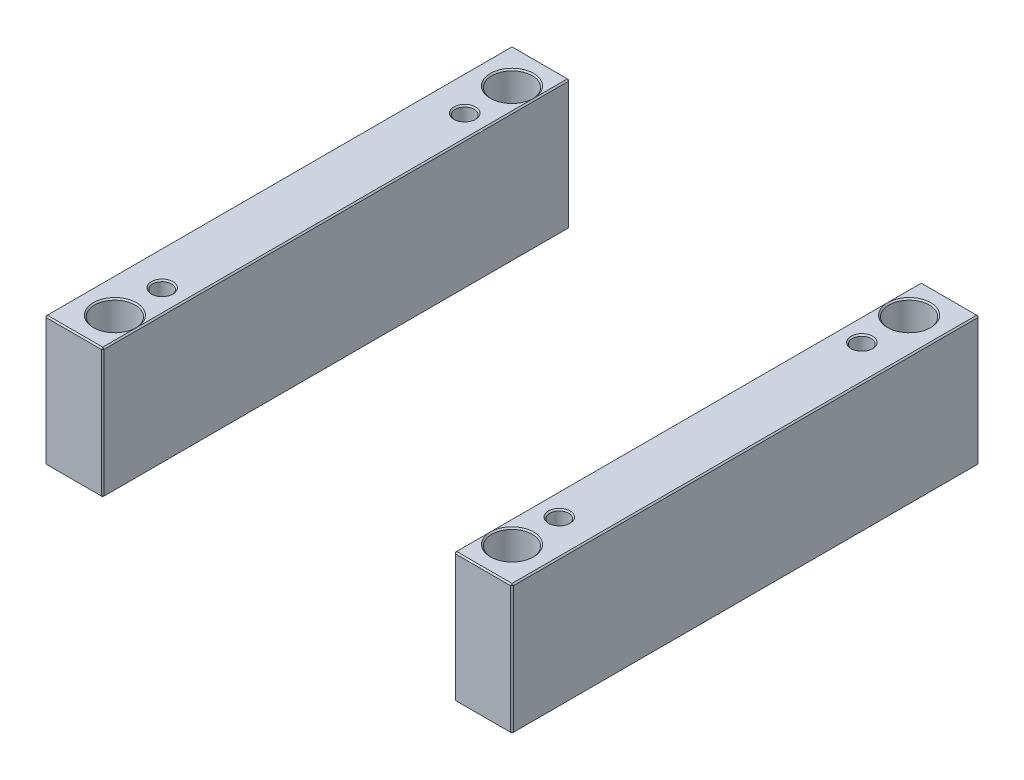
ISO-10303-21;
HEADER;
FILE_DESCRIPTION(('STEP AP214'),'2;1');
FILE_NAME('part.step','',(''),(''),'','','');
FILE_SCHEMA(('AUTOMOTIVE_DESIGN { 1 0 10303 214 1 1 1 1 }'));
ENDSEC;
DATA;
#1=APPLICATION_CONTEXT('core data for automotive mechanical design processes');
#2=APPLICATION_PROTOCOL_DEFINITION('international standard','automotive_design',2000,#1);
#3=PRODUCT_CONTEXT('',#1,'mechanical');
#4=PRODUCT('Part','Part','',(#3));
#5=PRODUCT_RELATED_PRODUCT_CATEGORY('part','',(#4));
#6=PRODUCT_DEFINITION_FORMATION('','',#4);
#7=PRODUCT_DEFINITION_CONTEXT('part definition',#1,'design');
#8=PRODUCT_DEFINITION('design','',#6,#7);
#9=PRODUCT_DEFINITION_SHAPE('','',#8);
#10=(LENGTH_UNIT() NAMED_UNIT(*) SI_UNIT(.MILLI.,.METRE.));
#11=(NAMED_UNIT(*) PLANE_ANGLE_UNIT() SI_UNIT($,.RADIAN.));
#12=(NAMED_UNIT(*) SI_UNIT($,.STERADIAN.) SOLID_ANGLE_UNIT());
#13=UNCERTAINTY_MEASURE_WITH_UNIT(LENGTH_MEASURE(1.E-05),#10,'distance_accuracy_value','');
#14=(GEOMETRIC_REPRESENTATION_CONTEXT(3) GLOBAL_UNCERTAINTY_ASSIGNED_CONTEXT((#13)) GLOBAL_UNIT_ASSIGNED_CONTEXT((#10,
#11,#12)) REPRESENTATION_CONTEXT('',''));
#15=CARTESIAN_POINT('',(0.,0.,0.));
#16=DIRECTION('',(0.,0.,1.));
#17=DIRECTION('',(1.,0.,0.));
#18=AXIS2_PLACEMENT_3D('',#15,#16,#17);
#19=CARTESIAN_POINT('',(-173.,96.,-173.));
#20=DIRECTION('',(0.,0.,1.));
#21=DIRECTION('',(1.,0.,0.));
#22=AXIS2_PLACEMENT_3D('',#19,#20,#21);
#23=PLANE('',#22);
#24=DIRECTION('',(-1.,0.,0.));
#25=VECTOR('',#24,1.);
#26=CARTESIAN_POINT('',(-173.,1.,-173.));
#27=LINE('',#26,#25);
#28=CARTESIAN_POINT('',(-131.,1.,-173.));
#29=VERTEX_POINT('',#28);
#30=CARTESIAN_POINT('',(-172.,1.,-173.));
#31=VERTEX_POINT('',#30);
#32=EDGE_CURVE('P0_E151',#29,#31,#27,.T.);
#33=ORIENTED_EDGE('',*,*,#32,.T.);
#34=DIRECTION('',(0.,1.,0.));
#35=VECTOR('',#34,1.);
#36=CARTESIAN_POINT('',(-172.,96.,-173.));
#37=LINE('',#36,#35);
#38=CARTESIAN_POINT('',(-172.,95.,-173.));
#39=VERTEX_POINT('',#38);
#40=EDGE_CURVE('P0_E266',#31,#39,#37,.T.);
#41=ORIENTED_EDGE('',*,*,#40,.T.);
#42=DIRECTION('',(1.,0.,0.));
#43=VECTOR('',#42,1.);
#44=CARTESIAN_POINT('',(-173.,95.,-173.));
#45=LINE('',#44,#43);
#46=CARTESIAN_POINT('',(-131.,95.,-173.));
#47=VERTEX_POINT('',#46);
#48=EDGE_CURVE('P0_E264',#39,#47,#45,.T.);
#49=ORIENTED_EDGE('',*,*,#48,.T.);
#50=DIRECTION('',(0.,-1.,0.));
#51=VECTOR('',#50,1.);
#52=CARTESIAN_POINT('',(-131.,96.,-173.));
#53=LINE('',#52,#51);
#54=EDGE_CURVE('P0_E261',#47,#29,#53,.T.);
#55=ORIENTED_EDGE('',*,*,#54,.T.);
#56=EDGE_LOOP('',(#33,#41,#49,#55));
#57=FACE_BOUND('',#56,.T.);
#58=ADVANCED_FACE('P0_F16',(#57),#23,.F.);
#59=CARTESIAN_POINT('',(-173.,96.,173.));
#60=DIRECTION('',(1.,0.,0.));
#61=DIRECTION('',(0.,0.,-1.));
#62=AXIS2_PLACEMENT_3D('',#59,#60,#61);
#63=PLANE('',#62);
#64=DIRECTION('',(0.,1.,0.));
#65=VECTOR('',#64,1.);
#66=CARTESIAN_POINT('',(-173.,96.,172.));
#67=LINE('',#66,#65);
#68=CARTESIAN_POINT('',(-173.,1.,172.));
#69=VERTEX_POINT('',#68);
#70=CARTESIAN_POINT('',(-173.,95.,172.));
#71=VERTEX_POINT('',#70);
#72=EDGE_CURVE('P0_E254',#69,#71,#67,.T.);
#73=ORIENTED_EDGE('',*,*,#72,.T.);
#74=DIRECTION('',(0.,0.,-1.));
#75=VECTOR('',#74,1.);
#76=CARTESIAN_POINT('',(-173.,95.,173.));
#77=LINE('',#76,#75);
#78=CARTESIAN_POINT('',(-173.,95.,-172.));
#79=VERTEX_POINT('',#78);
#80=EDGE_CURVE('P0_E259',#71,#79,#77,.T.);
#81=ORIENTED_EDGE('',*,*,#80,.T.);
#82=DIRECTION('',(0.,-1.,0.));
#83=VECTOR('',#82,1.);
#84=CARTESIAN_POINT('',(-173.,96.,-172.));
#85=LINE('',#84,#83);
#86=CARTESIAN_POINT('',(-173.,1.,-172.));
#87=VERTEX_POINT('',#86);
#88=EDGE_CURVE('P0_E256',#79,#87,#85,.T.);
#89=ORIENTED_EDGE('',*,*,#88,.T.);
#90=DIRECTION('',(0.,0.,1.));
#91=VECTOR('',#90,1.);
#92=CARTESIAN_POINT('',(-173.,1.,173.));
#93=LINE('',#92,#91);
#94=EDGE_CURVE('P0_E252',#87,#69,#93,.T.);
#95=ORIENTED_EDGE('',*,*,#94,.T.);
#96=EDGE_LOOP('',(#73,#81,#89,#95));
#97=FACE_BOUND('',#96,.T.);
#98=ADVANCED_FACE('P0_F340',(#97),#63,.F.);
#99=CARTESIAN_POINT('',(-173.,96.,173.));
#100=DIRECTION('',(0.,0.,-1.));
#101=DIRECTION('',(-1.,0.,0.));
#102=AXIS2_PLACEMENT_3D('',#99,#100,#101);
#103=PLANE('',#102);
#104=DIRECTION('',(-1.,0.,0.));
#105=VECTOR('',#104,1.);
#106=CARTESIAN_POINT('',(-173.,95.,173.));
#107=LINE('',#106,#105);
#108=CARTESIAN_POINT('',(-131.,95.,173.));
#109=VERTEX_POINT('',#108);
#110=CARTESIAN_POINT('',(-172.,95.,173.));
#111=VERTEX_POINT('',#110);
#112=EDGE_CURVE('P0_E273',#109,#111,#107,.T.);
#113=ORIENTED_EDGE('',*,*,#112,.T.);
#114=DIRECTION('',(0.,-1.,0.));
#115=VECTOR('',#114,1.);
#116=CARTESIAN_POINT('',(-172.,96.,173.));
#117=LINE('',#116,#115);
#118=CARTESIAN_POINT('',(-172.,1.,173.));
#119=VERTEX_POINT('',#118);
#120=EDGE_CURVE('P0_E275',#111,#119,#117,.T.);
#121=ORIENTED_EDGE('',*,*,#120,.T.);
#122=DIRECTION('',(1.,0.,0.));
#123=VECTOR('',#122,1.);
#124=CARTESIAN_POINT('',(-130.,1.,173.));
#125=LINE('',#124,#123);
#126=CARTESIAN_POINT('',(-131.,1.,173.));
#127=VERTEX_POINT('',#126);
#128=EDGE_CURVE('P0_E271',#119,#127,#125,.T.);
#129=ORIENTED_EDGE('',*,*,#128,.T.);
#130=DIRECTION('',(0.,1.,0.));
#131=VECTOR('',#130,1.);
#132=CARTESIAN_POINT('',(-131.,96.,173.));
#133=LINE('',#132,#131);
#134=EDGE_CURVE('P0_E269',#127,#109,#133,.T.);
#135=ORIENTED_EDGE('',*,*,#134,.T.);
#136=EDGE_LOOP('',(#113,#121,#129,#135));
#137=FACE_BOUND('',#136,.T.);
#138=ADVANCED_FACE('P0_F395',(#137),#103,.F.);
#139=CARTESIAN_POINT('',(-130.,96.,-173.));
#140=DIRECTION('',(-1.,0.,0.));
#141=DIRECTION('',(0.,0.,1.));
#142=AXIS2_PLACEMENT_3D('',#139,#140,#141);
#143=PLANE('',#142);
#144=DIRECTION('',(0.,0.,1.));
#145=VECTOR('',#144,1.);
#146=CARTESIAN_POINT('',(-130.,95.,-173.));
#147=LINE('',#146,#145);
#148=CARTESIAN_POINT('',(-130.,95.,-172.));
#149=VERTEX_POINT('',#148);
#150=CARTESIAN_POINT('',(-130.,95.,172.));
#151=VERTEX_POINT('',#150);
#152=EDGE_CURVE('P0_E294',#149,#151,#147,.T.);
#153=ORIENTED_EDGE('',*,*,#152,.T.);
#154=DIRECTION('',(0.,-1.,0.));
#155=VECTOR('',#154,1.);
#156=CARTESIAN_POINT('',(-130.,96.,172.));
#157=LINE('',#156,#155);
#158=CARTESIAN_POINT('',(-130.,1.,172.));
#159=VERTEX_POINT('',#158);
#160=EDGE_CURVE('P0_E206',#151,#159,#157,.T.);
#161=ORIENTED_EDGE('',*,*,#160,.T.);
#162=DIRECTION('',(0.,0.,-1.));
#163=VECTOR('',#162,1.);
#164=CARTESIAN_POINT('',(-130.,1.,-173.));
#165=LINE('',#164,#163);
#166=CARTESIAN_POINT('',(-130.,1.,-172.));
#167=VERTEX_POINT('',#166);
#168=EDGE_CURVE('P0_E290',#159,#167,#165,.T.);
#169=ORIENTED_EDGE('',*,*,#168,.T.);
#170=DIRECTION('',(0.,1.,0.));
#171=VECTOR('',#170,1.);
#172=CARTESIAN_POINT('',(-130.,96.,-172.));
#173=LINE('',#172,#171);
#174=EDGE_CURVE('P0_E292',#167,#149,#173,.T.);
#175=ORIENTED_EDGE('',*,*,#174,.T.);
#176=EDGE_LOOP('',(#153,#161,#169,#175));
#177=FACE_BOUND('',#176,.T.);
#178=ADVANCED_FACE('P0_F370',(#177),#143,.F.);
#179=CARTESIAN_POINT('',(0.,96.,0.));
#180=DIRECTION('',(0.,-1.,0.));
#181=DIRECTION('',(0.,0.,-1.));
#182=AXIS2_PLACEMENT_3D('',#179,#180,#181);
#183=PLANE('',#182);
#184=CARTESIAN_POINT('',(-147.,96.,112.));
#185=DIRECTION('',(0.,-1.,0.));
#186=DIRECTION('',(0.,0.,-1.));
#187=AXIS2_PLACEMENT_3D('',#184,#185,#186);
#188=CIRCLE('',#187,8.);
#189=CARTESIAN_POINT('',(-147.,96.,104.));
#190=VERTEX_POINT('',#189);
#191=EDGE_CURVE('P0_E209',#190,#190,#188,.T.);
#192=ORIENTED_EDGE('',*,*,#191,.T.);
#193=EDGE_LOOP('',(#192));
#194=FACE_BOUND('',#193,.T.);
#195=CARTESIAN_POINT('',(-147.,96.,-112.));
#196=DIRECTION('',(0.,-1.,0.));
#197=DIRECTION('',(0.,0.,-1.));
#198=AXIS2_PLACEMENT_3D('',#195,#196,#197);
#199=CIRCLE('',#198,8.);
#200=CARTESIAN_POINT('',(-147.,96.,-120.));
#201=VERTEX_POINT('',#200);
#202=EDGE_CURVE('P0_E205',#201,#201,#199,.T.);
#203=ORIENTED_EDGE('',*,*,#202,.T.);
#204=EDGE_LOOP('',(#203));
#205=FACE_BOUND('',#204,.T.);
#206=DIRECTION('',(0.,0.,-1.));
#207=VECTOR('',#206,1.);
#208=CARTESIAN_POINT('',(-131.,96.,0.));
#209=LINE('',#208,#207);
#210=CARTESIAN_POINT('',(-131.,96.,147.));
#211=VERTEX_POINT('',#210);
#212=CARTESIAN_POINT('',(-131.,96.,-147.));
#213=VERTEX_POINT('',#212);
#214=EDGE_CURVE('P0_E283',#211,#213,#209,.T.);
#215=ORIENTED_EDGE('',*,*,#214,.T.);
#216=CARTESIAN_POINT('',(-147.,96.,-147.));
#217=DIRECTION('',(0.,-1.,0.));
#218=DIRECTION('',(0.,0.,-1.));
#219=AXIS2_PLACEMENT_3D('',#216,#217,#218);
#220=CIRCLE('',#219,16.);
#221=EDGE_CURVE('P0_E29',#213,#213,#220,.T.);
#222=ORIENTED_EDGE('',*,*,#221,.T.);
#223=CARTESIAN_POINT('',(-131.,96.,-172.));
#224=VERTEX_POINT('',#223);
#225=EDGE_CURVE('P0_E278',#213,#224,#209,.T.);
#226=ORIENTED_EDGE('',*,*,#225,.T.);
#227=DIRECTION('',(-1.,0.,0.));
#228=VECTOR('',#227,1.);
#229=CARTESIAN_POINT('',(-1.11022302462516E-13,96.,-172.));
#230=LINE('',#229,#228);
#231=CARTESIAN_POINT('',(-172.,96.,-172.));
#232=VERTEX_POINT('',#231);
#233=EDGE_CURVE('P0_E282',#224,#232,#230,.T.);
#234=ORIENTED_EDGE('',*,*,#233,.T.);
#235=DIRECTION('',(0.,0.,1.));
#236=VECTOR('',#235,1.);
#237=CARTESIAN_POINT('',(-172.,96.,0.));
#238=LINE('',#237,#236);
#239=CARTESIAN_POINT('',(-172.,96.,172.));
#240=VERTEX_POINT('',#239);
#241=EDGE_CURVE('P0_E285',#232,#240,#238,.T.);
#242=ORIENTED_EDGE('',*,*,#241,.T.);
#243=DIRECTION('',(1.,0.,0.));
#244=VECTOR('',#243,1.);
#245=CARTESIAN_POINT('',(1.11022302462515E-13,96.,172.));
#246=LINE('',#245,#244);
#247=CARTESIAN_POINT('',(-131.,96.,172.));
#248=VERTEX_POINT('',#247);
#249=EDGE_CURVE('P0_E287',#240,#248,#246,.T.);
#250=ORIENTED_EDGE('',*,*,#249,.T.);
#251=EDGE_CURVE('P0_E279',#248,#211,#209,.T.);
#252=ORIENTED_EDGE('',*,*,#251,.T.);
#253=CARTESIAN_POINT('',(-147.,96.,147.));
#254=DIRECTION('',(0.,-1.,0.));
#255=DIRECTION('',(0.,0.,-1.));
#256=AXIS2_PLACEMENT_3D('',#253,#254,#255);
#257=CIRCLE('',#256,16.);
#258=EDGE_CURVE('P0_E34',#211,#211,#257,.T.);
#259=ORIENTED_EDGE('',*,*,#258,.T.);
#260=EDGE_LOOP('',(#215,#222,#226,#234,#242,#250,#252,#259));
#261=FACE_BOUND('',#260,.T.);
#262=ADVANCED_FACE('P0_F354',(#194,#205,#261),#183,.F.);
#263=CARTESIAN_POINT('',(0.,0.,0.));
#264=DIRECTION('',(0.,-1.,0.));
#265=DIRECTION('',(0.,0.,-1.));
#266=AXIS2_PLACEMENT_3D('',#263,#264,#265);
#267=PLANE('',#266);
#268=CARTESIAN_POINT('',(-147.,0.,-112.));
#269=DIRECTION('',(0.,-1.,0.));
#270=DIRECTION('',(0.,0.,-1.));
#271=AXIS2_PLACEMENT_3D('',#268,#269,#270);
#272=CIRCLE('',#271,8.);
#273=CARTESIAN_POINT('',(-147.,0.,-120.));
#274=VERTEX_POINT('',#273);
#275=EDGE_CURVE('P0_E243',#274,#274,#272,.F.);
#276=ORIENTED_EDGE('',*,*,#275,.T.);
#277=EDGE_LOOP('',(#276));
#278=FACE_BOUND('',#277,.T.);
#279=CARTESIAN_POINT('',(-147.,0.,112.));
#280=DIRECTION('',(0.,-1.,0.));
#281=DIRECTION('',(0.,0.,-1.));
#282=AXIS2_PLACEMENT_3D('',#279,#280,#281);
#283=CIRCLE('',#282,8.);
#284=CARTESIAN_POINT('',(-147.,0.,104.));
#285=VERTEX_POINT('',#284);
#286=EDGE_CURVE('P0_E240',#285,#285,#283,.F.);
#287=ORIENTED_EDGE('',*,*,#286,.T.);
#288=EDGE_LOOP('',(#287));
#289=FACE_BOUND('',#288,.T.);
#290=DIRECTION('',(0.,0.,1.));
#291=VECTOR('',#290,1.);
#292=CARTESIAN_POINT('',(-131.,0.,173.));
#293=LINE('',#292,#291);
#294=CARTESIAN_POINT('',(-131.,0.,-172.));
#295=VERTEX_POINT('',#294);
#296=CARTESIAN_POINT('',(-131.,0.,-147.));
#297=VERTEX_POINT('',#296);
#298=EDGE_CURVE('P0_E120',#295,#297,#293,.T.);
#299=ORIENTED_EDGE('',*,*,#298,.T.);
#300=CARTESIAN_POINT('',(-147.,0.,-147.));
#301=DIRECTION('',(0.,-1.,0.));
#302=DIRECTION('',(0.,0.,-1.));
#303=AXIS2_PLACEMENT_3D('',#300,#301,#302);
#304=CIRCLE('',#303,16.);
#305=EDGE_CURVE('P0_E218',#297,#297,#304,.F.);
#306=ORIENTED_EDGE('',*,*,#305,.T.);
#307=CARTESIAN_POINT('',(-131.,0.,147.));
#308=VERTEX_POINT('',#307);
#309=EDGE_CURVE('P0_E138',#297,#308,#293,.T.);
#310=ORIENTED_EDGE('',*,*,#309,.T.);
#311=CARTESIAN_POINT('',(-147.,0.,147.));
#312=DIRECTION('',(0.,-1.,0.));
#313=DIRECTION('',(0.,0.,-1.));
#314=AXIS2_PLACEMENT_3D('',#311,#312,#313);
#315=CIRCLE('',#314,16.);
#316=EDGE_CURVE('P0_E215',#308,#308,#315,.F.);
#317=ORIENTED_EDGE('',*,*,#316,.T.);
#318=CARTESIAN_POINT('',(-131.,0.,172.));
#319=VERTEX_POINT('',#318);
#320=EDGE_CURVE('P0_E140',#308,#319,#293,.T.);
#321=ORIENTED_EDGE('',*,*,#320,.T.);
#322=DIRECTION('',(-1.,0.,0.));
#323=VECTOR('',#322,1.);
#324=CARTESIAN_POINT('',(-173.,0.,172.));
#325=LINE('',#324,#323);
#326=CARTESIAN_POINT('',(-172.,0.,172.));
#327=VERTEX_POINT('',#326);
#328=EDGE_CURVE('P0_E126',#319,#327,#325,.T.);
#329=ORIENTED_EDGE('',*,*,#328,.T.);
#330=DIRECTION('',(0.,0.,-1.));
#331=VECTOR('',#330,1.);
#332=CARTESIAN_POINT('',(-172.,0.,-173.));
#333=LINE('',#332,#331);
#334=CARTESIAN_POINT('',(-172.,0.,-172.));
#335=VERTEX_POINT('',#334);
#336=EDGE_CURVE('P0_E122',#327,#335,#333,.T.);
#337=ORIENTED_EDGE('',*,*,#336,.T.);
#338=DIRECTION('',(1.,0.,0.));
#339=VECTOR('',#338,1.);
#340=CARTESIAN_POINT('',(-130.,0.,-172.));
#341=LINE('',#340,#339);
#342=EDGE_CURVE('P0_E116',#335,#295,#341,.T.);
#343=ORIENTED_EDGE('',*,*,#342,.T.);
#344=EDGE_LOOP('',(#299,#306,#310,#317,#321,#329,#337,#343));
#345=FACE_BOUND('',#344,.T.);
#346=ADVANCED_FACE('P0_F118',(#278,#289,#345),#267,.T.);
#347=CARTESIAN_POINT('',(-147.,0.,-112.));
#348=DIRECTION('',(0.,1.,0.));
#349=DIRECTION('',(0.,0.,1.));
#350=AXIS2_PLACEMENT_3D('',#347,#348,#349);
#351=CYLINDRICAL_SURFACE('',#350,7.);
#352=CARTESIAN_POINT('',(-147.,95.,-112.));
#353=DIRECTION('',(0.,-1.,0.));
#354=DIRECTION('',(0.,0.,-1.));
#355=AXIS2_PLACEMENT_3D('',#352,#353,#354);
#356=CIRCLE('',#355,7.);
#357=CARTESIAN_POINT('',(-147.,95.,-119.));
#358=VERTEX_POINT('',#357);
#359=EDGE_CURVE('P0_E212',#358,#358,#356,.F.);
#360=ORIENTED_EDGE('',*,*,#359,.T.);
#361=EDGE_LOOP('',(#360));
#362=FACE_BOUND('',#361,.T.);
#363=CARTESIAN_POINT('',(-147.,1.00000000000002,-112.));
#364=DIRECTION('',(0.,-1.,0.));
#365=DIRECTION('',(0.,0.,-1.));
#366=AXIS2_PLACEMENT_3D('',#363,#364,#365);
#367=CIRCLE('',#366,7.);
#368=CARTESIAN_POINT('',(-147.,1.00000000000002,-119.));
#369=VERTEX_POINT('',#368);
#370=EDGE_CURVE('P0_E246',#369,#369,#367,.T.);
#371=ORIENTED_EDGE('',*,*,#370,.T.);
#372=EDGE_LOOP('',(#371));
#373=FACE_BOUND('',#372,.T.);
#374=ADVANCED_FACE('P0_F445',(#362,#373),#351,.F.);
#375=CARTESIAN_POINT('',(-147.,0.,112.));
#376=DIRECTION('',(0.,1.,0.));
#377=DIRECTION('',(0.,0.,1.));
#378=AXIS2_PLACEMENT_3D('',#375,#376,#377);
#379=CYLINDRICAL_SURFACE('',#378,7.);
#380=CARTESIAN_POINT('',(-147.,95.,112.));
#381=DIRECTION('',(0.,-1.,0.));
#382=DIRECTION('',(0.,0.,-1.));
#383=AXIS2_PLACEMENT_3D('',#380,#381,#382);
#384=CIRCLE('',#383,7.);
#385=CARTESIAN_POINT('',(-147.,95.,105.));
#386=VERTEX_POINT('',#385);
#387=EDGE_CURVE('P0_E202',#386,#386,#384,.F.);
#388=ORIENTED_EDGE('',*,*,#387,.T.);
#389=EDGE_LOOP('',(#388));
#390=FACE_BOUND('',#389,.T.);
#391=CARTESIAN_POINT('',(-147.,1.00000000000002,112.));
#392=DIRECTION('',(0.,-1.,0.));
#393=DIRECTION('',(0.,0.,-1.));
#394=AXIS2_PLACEMENT_3D('',#391,#392,#393);
#395=CIRCLE('',#394,7.);
#396=CARTESIAN_POINT('',(-147.,1.00000000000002,105.));
#397=VERTEX_POINT('',#396);
#398=EDGE_CURVE('P0_E249',#397,#397,#395,.T.);
#399=ORIENTED_EDGE('',*,*,#398,.T.);
#400=EDGE_LOOP('',(#399));
#401=FACE_BOUND('',#400,.T.);
#402=ADVANCED_FACE('P0_F403',(#390,#401),#379,.F.);
#403=CARTESIAN_POINT('',(-147.,0.,-112.));
#404=DIRECTION('',(0.,-1.,0.));
#405=DIRECTION('',(0.,0.,-1.));
#406=AXIS2_PLACEMENT_3D('',#403,#404,#405);
#407=CONICAL_SURFACE('',#406,8.,0.78539816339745);
#408=ORIENTED_EDGE('',*,*,#370,.F.);
#409=EDGE_LOOP('',(#408));
#410=FACE_BOUND('',#409,.T.);
#411=ORIENTED_EDGE('',*,*,#275,.F.);
#412=EDGE_LOOP('',(#411));
#413=FACE_BOUND('',#412,.T.);
#414=ADVANCED_FACE('P0_F399',(#410,#413),#407,.F.);
#415=CARTESIAN_POINT('',(-147.,0.,112.));
#416=DIRECTION('',(0.,-1.,0.));
#417=DIRECTION('',(0.,0.,-1.));
#418=AXIS2_PLACEMENT_3D('',#415,#416,#417);
#419=CONICAL_SURFACE('',#418,8.,0.78539816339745);
#420=ORIENTED_EDGE('',*,*,#398,.F.);
#421=EDGE_LOOP('',(#420));
#422=FACE_BOUND('',#421,.T.);
#423=ORIENTED_EDGE('',*,*,#286,.F.);
#424=EDGE_LOOP('',(#423));
#425=FACE_BOUND('',#424,.T.);
#426=ADVANCED_FACE('P0_F402',(#422,#425),#419,.F.);
#427=CARTESIAN_POINT('',(-130.,96.,172.));
#428=DIRECTION('',(-0.707106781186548,0.,-0.707106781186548));
#429=DIRECTION('',(0.,-1.,0.));
#430=AXIS2_PLACEMENT_3D('',#427,#428,#429);
#431=PLANE('',#430);
#432=DIRECTION('',(-0.707106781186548,0.,0.707106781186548));
#433=VECTOR('',#432,1.);
#434=CARTESIAN_POINT('',(-130.5,95.,172.5));
#435=LINE('',#434,#433);
#436=EDGE_CURVE('P0_E199',#109,#151,#435,.F.);
#437=ORIENTED_EDGE('',*,*,#436,.F.);
#438=ORIENTED_EDGE('',*,*,#134,.F.);
#439=DIRECTION('',(0.707106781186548,0.,-0.707106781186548));
#440=VECTOR('',#439,1.);
#441=CARTESIAN_POINT('',(-131.,1.,173.));
#442=LINE('',#441,#440);
#443=EDGE_CURVE('P0_E196',#159,#127,#442,.F.);
#444=ORIENTED_EDGE('',*,*,#443,.F.);
#445=ORIENTED_EDGE('',*,*,#160,.F.);
#446=EDGE_LOOP('',(#437,#438,#444,#445));
#447=FACE_BOUND('',#446,.T.);
#448=ADVANCED_FACE('P0_F367',(#447),#431,.F.);
#449=CARTESIAN_POINT('',(-131.,96.,172.));
#450=DIRECTION('',(0.57735026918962,0.577350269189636,0.57735026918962));
#451=DIRECTION('',(0.,-0.707106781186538,0.707106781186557));
#452=AXIS2_PLACEMENT_3D('',#449,#450,#451);
#453=PLANE('',#452);
#454=DIRECTION('',(0.,0.707106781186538,-0.707106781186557));
#455=VECTOR('',#454,1.);
#456=CARTESIAN_POINT('',(-131.,96.,172.));
#457=LINE('',#456,#455);
#458=EDGE_CURVE('P0_E190',#109,#248,#457,.T.);
#459=ORIENTED_EDGE('',*,*,#458,.F.);
#460=ORIENTED_EDGE('',*,*,#436,.T.);
#461=DIRECTION('',(0.707106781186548,-0.707106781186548,0.));
#462=VECTOR('',#461,1.);
#463=CARTESIAN_POINT('',(-131.,96.,172.));
#464=LINE('',#463,#462);
#465=EDGE_CURVE('P0_E193',#248,#151,#464,.T.);
#466=ORIENTED_EDGE('',*,*,#465,.F.);
#467=EDGE_LOOP('',(#459,#460,#466));
#468=FACE_BOUND('',#467,.T.);
#469=ADVANCED_FACE('P0_F362',(#468),#453,.T.);
#470=CARTESIAN_POINT('',(-131.,1.,173.));
#471=DIRECTION('',(0.57735026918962,-0.577350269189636,0.57735026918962));
#472=DIRECTION('',(0.,-0.707106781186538,-0.707106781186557));
#473=AXIS2_PLACEMENT_3D('',#470,#471,#472);
#474=PLANE('',#473);
#475=DIRECTION('',(0.707106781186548,0.707106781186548,0.));
#476=VECTOR('',#475,1.);
#477=CARTESIAN_POINT('',(-130.5,0.500000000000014,172.));
#478=LINE('',#477,#476);
#479=EDGE_CURVE('P0_E185',#159,#319,#478,.F.);
#480=ORIENTED_EDGE('',*,*,#479,.F.);
#481=ORIENTED_EDGE('',*,*,#443,.T.);
#482=DIRECTION('',(0.,-0.707106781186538,-0.707106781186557));
#483=VECTOR('',#482,1.);
#484=CARTESIAN_POINT('',(-131.,1.,173.));
#485=LINE('',#484,#483);
#486=EDGE_CURVE('P0_E187',#319,#127,#485,.F.);
#487=ORIENTED_EDGE('',*,*,#486,.F.);
#488=EDGE_LOOP('',(#480,#481,#487));
#489=FACE_BOUND('',#488,.T.);
#490=ADVANCED_FACE('P0_F492',(#489),#474,.T.);
#491=CARTESIAN_POINT('',(-131.,96.,0.));
#492=DIRECTION('',(-0.707106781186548,-0.707106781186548,0.));
#493=DIRECTION('',(0.,0.,-1.));
#494=AXIS2_PLACEMENT_3D('',#491,#492,#493);
#495=PLANE('',#494);
#496=ORIENTED_EDGE('',*,*,#465,.T.);
#497=ORIENTED_EDGE('',*,*,#152,.F.);
#498=DIRECTION('',(-0.707106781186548,0.707106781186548,0.));
#499=VECTOR('',#498,1.);
#500=CARTESIAN_POINT('',(-130.5,95.5,-172.));
#501=LINE('',#500,#499);
#502=EDGE_CURVE('P0_E179',#224,#149,#501,.F.);
#503=ORIENTED_EDGE('',*,*,#502,.F.);
#504=ORIENTED_EDGE('',*,*,#225,.F.);
#505=ORIENTED_EDGE('',*,*,#214,.F.);
#506=ORIENTED_EDGE('',*,*,#251,.F.);
#507=EDGE_LOOP('',(#496,#497,#503,#504,#505,#506));
#508=FACE_BOUND('',#507,.T.);
#509=ADVANCED_FACE('P0_F358',(#508),#495,.F.);
#510=CARTESIAN_POINT('',(1.11022302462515E-13,96.,172.));
#511=DIRECTION('',(0.,-0.707106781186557,-0.707106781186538));
#512=DIRECTION('',(1.,0.,0.));
#513=AXIS2_PLACEMENT_3D('',#510,#511,#512);
#514=PLANE('',#513);
#515=ORIENTED_EDGE('',*,*,#458,.T.);
#516=ORIENTED_EDGE('',*,*,#249,.F.);
#517=DIRECTION('',(0.,-0.707106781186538,0.707106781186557));
#518=VECTOR('',#517,1.);
#519=CARTESIAN_POINT('',(-172.,95.5,172.5));
#520=LINE('',#519,#518);
#521=EDGE_CURVE('P0_E176',#111,#240,#520,.F.);
#522=ORIENTED_EDGE('',*,*,#521,.F.);
#523=ORIENTED_EDGE('',*,*,#112,.F.);
#524=EDGE_LOOP('',(#515,#516,#522,#523));
#525=FACE_BOUND('',#524,.T.);
#526=ADVANCED_FACE('P0_F351',(#525),#514,.F.);
#527=CARTESIAN_POINT('',(-172.,96.,173.));
#528=DIRECTION('',(0.707106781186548,0.,-0.707106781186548));
#529=DIRECTION('',(0.,-1.,0.));
#530=AXIS2_PLACEMENT_3D('',#527,#528,#529);
#531=PLANE('',#530);
#532=DIRECTION('',(0.707106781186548,0.,0.707106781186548));
#533=VECTOR('',#532,1.);
#534=CARTESIAN_POINT('',(-172.,1.,173.));
#535=LINE('',#534,#533);
#536=EDGE_CURVE('P0_E170',#119,#69,#535,.F.);
#537=ORIENTED_EDGE('',*,*,#536,.F.);
#538=ORIENTED_EDGE('',*,*,#120,.F.);
#539=DIRECTION('',(-0.707106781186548,0.,-0.707106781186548));
#540=VECTOR('',#539,1.);
#541=CARTESIAN_POINT('',(-173.,95.,172.));
#542=LINE('',#541,#540);
#543=EDGE_CURVE('P0_E173',#71,#111,#542,.F.);
#544=ORIENTED_EDGE('',*,*,#543,.F.);
#545=ORIENTED_EDGE('',*,*,#72,.F.);
#546=EDGE_LOOP('',(#537,#538,#544,#545));
#547=FACE_BOUND('',#546,.T.);
#548=ADVANCED_FACE('P0_F345',(#547),#531,.F.);
#549=CARTESIAN_POINT('',(-173.,1.,173.));
#550=DIRECTION('',(0.,-0.707106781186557,0.707106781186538));
#551=DIRECTION('',(-1.,0.,0.));
#552=AXIS2_PLACEMENT_3D('',#549,#550,#551);
#553=PLANE('',#552);
#554=ORIENTED_EDGE('',*,*,#486,.T.);
#555=ORIENTED_EDGE('',*,*,#128,.F.);
#556=DIRECTION('',(0.,0.707106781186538,0.707106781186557));
#557=VECTOR('',#556,1.);
#558=CARTESIAN_POINT('',(-172.,1.,173.));
#559=LINE('',#558,#557);
#560=EDGE_CURVE('P0_E148',#327,#119,#559,.T.);
#561=ORIENTED_EDGE('',*,*,#560,.F.);
#562=ORIENTED_EDGE('',*,*,#328,.F.);
#563=EDGE_LOOP('',(#554,#555,#561,#562));
#564=FACE_BOUND('',#563,.T.);
#565=ADVANCED_FACE('P0_F434',(#564),#553,.T.);
#566=CARTESIAN_POINT('',(-130.,1.,-173.));
#567=DIRECTION('',(0.707106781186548,-0.707106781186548,0.));
#568=DIRECTION('',(0.,0.,1.));
#569=AXIS2_PLACEMENT_3D('',#566,#567,#568);
#570=PLANE('',#569);
#571=ORIENTED_EDGE('',*,*,#479,.T.);
#572=ORIENTED_EDGE('',*,*,#320,.F.);
#573=ORIENTED_EDGE('',*,*,#309,.F.);
#574=ORIENTED_EDGE('',*,*,#298,.F.);
#575=DIRECTION('',(-0.707106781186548,-0.707106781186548,0.));
#576=VECTOR('',#575,1.);
#577=CARTESIAN_POINT('',(-131.,0.,-172.));
#578=LINE('',#577,#576);
#579=EDGE_CURVE('P0_E134',#167,#295,#578,.T.);
#580=ORIENTED_EDGE('',*,*,#579,.F.);
#581=ORIENTED_EDGE('',*,*,#168,.F.);
#582=EDGE_LOOP('',(#571,#572,#573,#574,#580,#581));
#583=FACE_BOUND('',#582,.T.);
#584=ADVANCED_FACE('P0_F133',(#583),#570,.T.);
#585=CARTESIAN_POINT('',(-131.,96.,-173.));
#586=DIRECTION('',(-0.707106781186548,0.,0.707106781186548));
#587=DIRECTION('',(0.,-1.,0.));
#588=AXIS2_PLACEMENT_3D('',#585,#586,#587);
#589=PLANE('',#588);
#590=DIRECTION('',(0.707106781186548,0.,0.707106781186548));
#591=VECTOR('',#590,1.);
#592=CARTESIAN_POINT('',(-131.,95.,-173.));
#593=LINE('',#592,#591);
#594=EDGE_CURVE('P0_E182',#149,#47,#593,.F.);
#595=ORIENTED_EDGE('',*,*,#594,.F.);
#596=ORIENTED_EDGE('',*,*,#174,.F.);
#597=DIRECTION('',(-0.707106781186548,0.,-0.707106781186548));
#598=VECTOR('',#597,1.);
#599=CARTESIAN_POINT('',(-130.5,1.,-172.5));
#600=LINE('',#599,#598);
#601=EDGE_CURVE('P0_E147',#29,#167,#600,.F.);
#602=ORIENTED_EDGE('',*,*,#601,.F.);
#603=ORIENTED_EDGE('',*,*,#54,.F.);
#604=EDGE_LOOP('',(#595,#596,#602,#603));
#605=FACE_BOUND('',#604,.T.);
#606=ADVANCED_FACE('P0_F375',(#605),#589,.F.);
#607=CARTESIAN_POINT('',(-131.,95.,-173.));
#608=DIRECTION('',(0.57735026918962,0.577350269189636,-0.57735026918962));
#609=DIRECTION('',(0.,0.707106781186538,0.707106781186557));
#610=AXIS2_PLACEMENT_3D('',#607,#608,#609);
#611=PLANE('',#610);
#612=ORIENTED_EDGE('',*,*,#502,.T.);
#613=ORIENTED_EDGE('',*,*,#594,.T.);
#614=DIRECTION('',(0.,-0.707106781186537,-0.707106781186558));
#615=VECTOR('',#614,1.);
#616=CARTESIAN_POINT('',(-131.,95.,-173.));
#617=LINE('',#616,#615);
#618=EDGE_CURVE('P0_E165',#224,#47,#617,.T.);
#619=ORIENTED_EDGE('',*,*,#618,.F.);
#620=EDGE_LOOP('',(#612,#613,#619));
#621=FACE_BOUND('',#620,.T.);
#622=ADVANCED_FACE('P0_F377',(#621),#611,.T.);
#623=CARTESIAN_POINT('',(-173.,95.,172.));
#624=DIRECTION('',(-0.57735026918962,0.577350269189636,0.57735026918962));
#625=DIRECTION('',(0.,-0.707106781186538,0.707106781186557));
#626=AXIS2_PLACEMENT_3D('',#623,#624,#625);
#627=PLANE('',#626);
#628=ORIENTED_EDGE('',*,*,#543,.T.);
#629=ORIENTED_EDGE('',*,*,#521,.T.);
#630=DIRECTION('',(0.707106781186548,0.707106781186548,0.));
#631=VECTOR('',#630,1.);
#632=CARTESIAN_POINT('',(-173.,95.,172.));
#633=LINE('',#632,#631);
#634=EDGE_CURVE('P0_E156',#71,#240,#633,.T.);
#635=ORIENTED_EDGE('',*,*,#634,.F.);
#636=EDGE_LOOP('',(#628,#629,#635));
#637=FACE_BOUND('',#636,.T.);
#638=ADVANCED_FACE('P0_F348',(#637),#627,.T.);
#639=CARTESIAN_POINT('',(-172.,1.,173.));
#640=DIRECTION('',(-0.57735026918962,-0.577350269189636,0.57735026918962));
#641=DIRECTION('',(0.,-0.707106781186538,-0.707106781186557));
#642=AXIS2_PLACEMENT_3D('',#639,#640,#641);
#643=PLANE('',#642);
#644=ORIENTED_EDGE('',*,*,#560,.T.);
#645=ORIENTED_EDGE('',*,*,#536,.T.);
#646=DIRECTION('',(0.707106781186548,-0.707106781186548,0.));
#647=VECTOR('',#646,1.);
#648=CARTESIAN_POINT('',(-172.5,0.500000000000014,172.));
#649=LINE('',#648,#647);
#650=EDGE_CURVE('P0_E152',#327,#69,#649,.F.);
#651=ORIENTED_EDGE('',*,*,#650,.F.);
#652=EDGE_LOOP('',(#644,#645,#651));
#653=FACE_BOUND('',#652,.T.);
#654=ADVANCED_FACE('P0_F386',(#653),#643,.T.);
#655=CARTESIAN_POINT('',(-131.,0.,-172.));
#656=DIRECTION('',(0.57735026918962,-0.577350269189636,-0.57735026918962));
#657=DIRECTION('',(0.,0.707106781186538,-0.707106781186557));
#658=AXIS2_PLACEMENT_3D('',#655,#656,#657);
#659=PLANE('',#658);
#660=ORIENTED_EDGE('',*,*,#601,.T.);
#661=ORIENTED_EDGE('',*,*,#579,.T.);
#662=DIRECTION('',(0.,0.707106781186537,-0.707106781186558));
#663=VECTOR('',#662,1.);
#664=CARTESIAN_POINT('',(-131.,0.,-172.));
#665=LINE('',#664,#663);
#666=EDGE_CURVE('P0_E144',#29,#295,#665,.F.);
#667=ORIENTED_EDGE('',*,*,#666,.F.);
#668=EDGE_LOOP('',(#660,#661,#667));
#669=FACE_BOUND('',#668,.T.);
#670=ADVANCED_FACE('P0_F143',(#669),#659,.T.);
#671=CARTESIAN_POINT('',(-1.11022302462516E-13,96.,-172.));
#672=DIRECTION('',(0.,-0.707106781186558,0.707106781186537));
#673=DIRECTION('',(-1.,0.,0.));
#674=AXIS2_PLACEMENT_3D('',#671,#672,#673);
#675=PLANE('',#674);
#676=ORIENTED_EDGE('',*,*,#618,.T.);
#677=ORIENTED_EDGE('',*,*,#48,.F.);
#678=DIRECTION('',(0.,0.707106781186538,0.707106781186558));
#679=VECTOR('',#678,1.);
#680=CARTESIAN_POINT('',(-172.,95.,-173.));
#681=LINE('',#680,#679);
#682=EDGE_CURVE('P0_E153',#232,#39,#681,.F.);
#683=ORIENTED_EDGE('',*,*,#682,.F.);
#684=ORIENTED_EDGE('',*,*,#233,.F.);
#685=EDGE_LOOP('',(#676,#677,#683,#684));
#686=FACE_BOUND('',#685,.T.);
#687=ADVANCED_FACE('P0_F323',(#686),#675,.F.);
#688=CARTESIAN_POINT('',(-172.,96.,0.));
#689=DIRECTION('',(0.707106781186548,-0.707106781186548,0.));
#690=DIRECTION('',(0.,0.,1.));
#691=AXIS2_PLACEMENT_3D('',#688,#689,#690);
#692=PLANE('',#691);
#693=ORIENTED_EDGE('',*,*,#634,.T.);
#694=ORIENTED_EDGE('',*,*,#241,.F.);
#695=DIRECTION('',(-0.707106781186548,-0.707106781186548,0.));
#696=VECTOR('',#695,1.);
#697=CARTESIAN_POINT('',(-172.5,95.5,-172.));
#698=LINE('',#697,#696);
#699=EDGE_CURVE('P0_E159',#79,#232,#698,.F.);
#700=ORIENTED_EDGE('',*,*,#699,.F.);
#701=ORIENTED_EDGE('',*,*,#80,.F.);
#702=EDGE_LOOP('',(#693,#694,#700,#701));
#703=FACE_BOUND('',#702,.T.);
#704=ADVANCED_FACE('P0_F317',(#703),#692,.F.);
#705=CARTESIAN_POINT('',(-173.,1.,173.));
#706=DIRECTION('',(-0.707106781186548,-0.707106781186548,0.));
#707=DIRECTION('',(0.,0.,-1.));
#708=AXIS2_PLACEMENT_3D('',#705,#706,#707);
#709=PLANE('',#708);
#710=ORIENTED_EDGE('',*,*,#650,.T.);
#711=ORIENTED_EDGE('',*,*,#94,.F.);
#712=DIRECTION('',(-0.707106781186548,0.707106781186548,0.));
#713=VECTOR('',#712,1.);
#714=CARTESIAN_POINT('',(-173.,1.,-172.));
#715=LINE('',#714,#713);
#716=EDGE_CURVE('P0_E304',#335,#87,#715,.T.);
#717=ORIENTED_EDGE('',*,*,#716,.F.);
#718=ORIENTED_EDGE('',*,*,#336,.F.);
#719=EDGE_LOOP('',(#710,#711,#717,#718));
#720=FACE_BOUND('',#719,.T.);
#721=ADVANCED_FACE('P0_F336',(#720),#709,.T.);
#722=CARTESIAN_POINT('',(-173.,1.,-173.));
#723=DIRECTION('',(0.,-0.707106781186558,-0.707106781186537));
#724=DIRECTION('',(1.,0.,0.));
#725=AXIS2_PLACEMENT_3D('',#722,#723,#724);
#726=PLANE('',#725);
#727=ORIENTED_EDGE('',*,*,#666,.T.);
#728=ORIENTED_EDGE('',*,*,#342,.F.);
#729=DIRECTION('',(0.,-0.707106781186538,0.707106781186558));
#730=VECTOR('',#729,1.);
#731=CARTESIAN_POINT('',(-172.,0.5,-172.5));
#732=LINE('',#731,#730);
#733=EDGE_CURVE('P0_E302',#31,#335,#732,.T.);
#734=ORIENTED_EDGE('',*,*,#733,.F.);
#735=ORIENTED_EDGE('',*,*,#32,.F.);
#736=EDGE_LOOP('',(#727,#728,#734,#735));
#737=FACE_BOUND('',#736,.T.);
#738=ADVANCED_FACE('P0_F150',(#737),#726,.T.);
#739=CARTESIAN_POINT('',(-172.,95.,-173.));
#740=DIRECTION('',(-0.57735026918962,0.577350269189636,-0.57735026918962));
#741=DIRECTION('',(0.,0.707106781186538,0.707106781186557));
#742=AXIS2_PLACEMENT_3D('',#739,#740,#741);
#743=PLANE('',#742);
#744=ORIENTED_EDGE('',*,*,#699,.T.);
#745=ORIENTED_EDGE('',*,*,#682,.T.);
#746=DIRECTION('',(0.707106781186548,0.,-0.707106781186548));
#747=VECTOR('',#746,1.);
#748=CARTESIAN_POINT('',(-172.,95.,-173.));
#749=LINE('',#748,#747);
#750=EDGE_CURVE('P0_E300',#79,#39,#749,.T.);
#751=ORIENTED_EDGE('',*,*,#750,.F.);
#752=EDGE_LOOP('',(#744,#745,#751));
#753=FACE_BOUND('',#752,.T.);
#754=ADVANCED_FACE('P0_F310',(#753),#743,.T.);
#755=CARTESIAN_POINT('',(-173.,1.,-172.));
#756=DIRECTION('',(-0.57735026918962,-0.577350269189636,-0.57735026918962));
#757=DIRECTION('',(0.,0.707106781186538,-0.707106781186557));
#758=AXIS2_PLACEMENT_3D('',#755,#756,#757);
#759=PLANE('',#758);
#760=ORIENTED_EDGE('',*,*,#733,.T.);
#761=ORIENTED_EDGE('',*,*,#716,.T.);
#762=DIRECTION('',(-0.707106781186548,0.,0.707106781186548));
#763=VECTOR('',#762,1.);
#764=CARTESIAN_POINT('',(-173.,1.,-172.));
#765=LINE('',#764,#763);
#766=EDGE_CURVE('P0_E298',#31,#87,#765,.T.);
#767=ORIENTED_EDGE('',*,*,#766,.F.);
#768=EDGE_LOOP('',(#760,#761,#767));
#769=FACE_BOUND('',#768,.T.);
#770=ADVANCED_FACE('P0_F332',(#769),#759,.T.);
#771=CARTESIAN_POINT('',(-173.,96.,-172.));
#772=DIRECTION('',(0.707106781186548,0.,0.707106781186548));
#773=DIRECTION('',(0.,-1.,0.));
#774=AXIS2_PLACEMENT_3D('',#771,#772,#773);
#775=PLANE('',#774);
#776=ORIENTED_EDGE('',*,*,#750,.T.);
#777=ORIENTED_EDGE('',*,*,#40,.F.);
#778=ORIENTED_EDGE('',*,*,#766,.T.);
#779=ORIENTED_EDGE('',*,*,#88,.F.);
#780=EDGE_LOOP('',(#776,#777,#778,#779));
#781=FACE_BOUND('',#780,.T.);
#782=ADVANCED_FACE('P0_F330',(#781),#775,.F.);
#783=CARTESIAN_POINT('',(-147.,95.,112.));
#784=DIRECTION('',(0.,1.,0.));
#785=DIRECTION('',(0.,0.,1.));
#786=AXIS2_PLACEMENT_3D('',#783,#784,#785);
#787=CONICAL_SURFACE('',#786,7.,0.785398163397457);
#788=ORIENTED_EDGE('',*,*,#191,.F.);
#789=EDGE_LOOP('',(#788));
#790=FACE_BOUND('',#789,.T.);
#791=ORIENTED_EDGE('',*,*,#387,.F.);
#792=EDGE_LOOP('',(#791));
#793=FACE_BOUND('',#792,.T.);
#794=ADVANCED_FACE('P0_F410',(#790,#793),#787,.F.);
#795=CARTESIAN_POINT('',(-147.,95.,-112.));
#796=DIRECTION('',(0.,1.,0.));
#797=DIRECTION('',(0.,0.,1.));
#798=AXIS2_PLACEMENT_3D('',#795,#796,#797);
#799=CONICAL_SURFACE('',#798,7.,0.785398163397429);
#800=ORIENTED_EDGE('',*,*,#202,.F.);
#801=EDGE_LOOP('',(#800));
#802=FACE_BOUND('',#801,.T.);
#803=ORIENTED_EDGE('',*,*,#359,.F.);
#804=EDGE_LOOP('',(#803));
#805=FACE_BOUND('',#804,.T.);
#806=ADVANCED_FACE('P0_F459',(#802,#805),#799,.F.);
#807=CARTESIAN_POINT('',(-147.,0.,147.));
#808=DIRECTION('',(0.,1.,0.));
#809=DIRECTION('',(0.,0.,1.));
#810=AXIS2_PLACEMENT_3D('',#807,#808,#809);
#811=CYLINDRICAL_SURFACE('',#810,15.);
#812=CARTESIAN_POINT('',(-147.,95.,147.));
#813=DIRECTION('',(0.,-1.,0.));
#814=DIRECTION('',(0.,0.,-1.));
#815=AXIS2_PLACEMENT_3D('',#812,#813,#814);
#816=CIRCLE('',#815,15.);
#817=CARTESIAN_POINT('',(-147.,95.,132.));
#818=VERTEX_POINT('',#817);
#819=EDGE_CURVE('P0_E10',#818,#818,#816,.F.);
#820=ORIENTED_EDGE('',*,*,#819,.T.);
#821=EDGE_LOOP('',(#820));
#822=FACE_BOUND('',#821,.T.);
#823=CARTESIAN_POINT('',(-147.,1.00000000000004,147.));
#824=DIRECTION('',(0.,-1.,0.));
#825=DIRECTION('',(0.,0.,-1.));
#826=AXIS2_PLACEMENT_3D('',#823,#824,#825);
#827=CIRCLE('',#826,15.);
#828=CARTESIAN_POINT('',(-147.,1.00000000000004,132.));
#829=VERTEX_POINT('',#828);
#830=EDGE_CURVE('P0_E24',#829,#829,#827,.T.);
#831=ORIENTED_EDGE('',*,*,#830,.T.);
#832=EDGE_LOOP('',(#831));
#833=FACE_BOUND('',#832,.T.);
#834=ADVANCED_FACE('P0_F230',(#822,#833),#811,.F.);
#835=CARTESIAN_POINT('',(-147.,0.,-147.));
#836=DIRECTION('',(0.,1.,0.));
#837=DIRECTION('',(0.,0.,1.));
#838=AXIS2_PLACEMENT_3D('',#835,#836,#837);
#839=CYLINDRICAL_SURFACE('',#838,15.);
#840=CARTESIAN_POINT('',(-147.,1.00000000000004,-147.));
#841=DIRECTION('',(0.,-1.,0.));
#842=DIRECTION('',(0.,0.,-1.));
#843=AXIS2_PLACEMENT_3D('',#840,#841,#842);
#844=CIRCLE('',#843,15.);
#845=CARTESIAN_POINT('',(-147.,1.00000000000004,-162.));
#846=VERTEX_POINT('',#845);
#847=EDGE_CURVE('P0_E223',#846,#846,#844,.T.);
#848=ORIENTED_EDGE('',*,*,#847,.T.);
#849=EDGE_LOOP('',(#848));
#850=FACE_BOUND('',#849,.T.);
#851=CARTESIAN_POINT('',(-147.,95.,-147.));
#852=DIRECTION('',(0.,-1.,0.));
#853=DIRECTION('',(0.,0.,-1.));
#854=AXIS2_PLACEMENT_3D('',#851,#852,#853);
#855=CIRCLE('',#854,15.);
#856=CARTESIAN_POINT('',(-147.,95.,-162.));
#857=VERTEX_POINT('',#856);
#858=EDGE_CURVE('P0_E220',#857,#857,#855,.F.);
#859=ORIENTED_EDGE('',*,*,#858,.T.);
#860=EDGE_LOOP('',(#859));
#861=FACE_BOUND('',#860,.T.);
#862=ADVANCED_FACE('P0_F458',(#850,#861),#839,.F.);
#863=CARTESIAN_POINT('',(-147.,0.,-147.));
#864=DIRECTION('',(0.,-1.,0.));
#865=DIRECTION('',(0.,0.,-1.));
#866=AXIS2_PLACEMENT_3D('',#863,#864,#865);
#867=CONICAL_SURFACE('',#866,16.,0.785398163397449);
#868=ORIENTED_EDGE('',*,*,#847,.F.);
#869=EDGE_LOOP('',(#868));
#870=FACE_BOUND('',#869,.T.);
#871=ORIENTED_EDGE('',*,*,#305,.F.);
#872=EDGE_LOOP('',(#871));
#873=FACE_BOUND('',#872,.T.);
#874=ADVANCED_FACE('P0_F462',(#870,#873),#867,.F.);
#875=CARTESIAN_POINT('',(-147.,95.,-147.));
#876=DIRECTION('',(0.,1.,0.));
#877=DIRECTION('',(0.,0.,1.));
#878=AXIS2_PLACEMENT_3D('',#875,#876,#877);
#879=CONICAL_SURFACE('',#878,15.,0.785398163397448);
#880=ORIENTED_EDGE('',*,*,#221,.F.);
#881=EDGE_LOOP('',(#880));
#882=FACE_BOUND('',#881,.T.);
#883=ORIENTED_EDGE('',*,*,#858,.F.);
#884=EDGE_LOOP('',(#883));
#885=FACE_BOUND('',#884,.T.);
#886=ADVANCED_FACE('P0_F468',(#882,#885),#879,.F.);
#887=CARTESIAN_POINT('',(-147.,95.,147.));
#888=DIRECTION('',(0.,1.,0.));
#889=DIRECTION('',(0.,0.,1.));
#890=AXIS2_PLACEMENT_3D('',#887,#888,#889);
#891=CONICAL_SURFACE('',#890,15.,0.785398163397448);
#892=ORIENTED_EDGE('',*,*,#258,.F.);
#893=EDGE_LOOP('',(#892));
#894=FACE_BOUND('',#893,.T.);
#895=ORIENTED_EDGE('',*,*,#819,.F.);
#896=EDGE_LOOP('',(#895));
#897=FACE_BOUND('',#896,.T.);
#898=ADVANCED_FACE('P0_F234',(#894,#897),#891,.F.);
#899=CARTESIAN_POINT('',(-147.,0.,147.));
#900=DIRECTION('',(0.,-1.,0.));
#901=DIRECTION('',(0.,0.,-1.));
#902=AXIS2_PLACEMENT_3D('',#899,#900,#901);
#903=CONICAL_SURFACE('',#902,16.,0.785398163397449);
#904=ORIENTED_EDGE('',*,*,#830,.F.);
#905=EDGE_LOOP('',(#904));
#906=FACE_BOUND('',#905,.T.);
#907=ORIENTED_EDGE('',*,*,#316,.F.);
#908=EDGE_LOOP('',(#907));
#909=FACE_BOUND('',#908,.T.);
#910=ADVANCED_FACE('P0_F18',(#906,#909),#903,.F.);
#911=CLOSED_SHELL('',(#58,#98,#138,#178,#262,#346,#374,#402,#414,#426,#448,#469,#490,#509,#526,
#548,#565,#584,#606,#622,#638,#654,#670,#687,#704,#721,#738,#754,#770,#782,#794,#806,#834,#862,
#874,#886,#898,#910));
#912=MANIFOLD_SOLID_BREP('P0_B1',#911);
#913=CARTESIAN_POINT('',(173.,96.,173.));
#914=DIRECTION('',(0.,0.,-1.));
#915=DIRECTION('',(-1.,0.,0.));
#916=AXIS2_PLACEMENT_3D('',#913,#914,#915);
#917=PLANE('',#916);
#918=DIRECTION('',(0.,-1.,0.));
#919=VECTOR('',#918,1.);
#920=CARTESIAN_POINT('',(131.,96.,173.));
#921=LINE('',#920,#919);
#922=CARTESIAN_POINT('',(131.,95.,173.));
#923=VERTEX_POINT('',#922);
#924=CARTESIAN_POINT('',(131.,1.,173.));
#925=VERTEX_POINT('',#924);
#926=EDGE_CURVE('P1_E189',#923,#925,#921,.T.);
#927=ORIENTED_EDGE('',*,*,#926,.T.);
#928=DIRECTION('',(1.,0.,0.));
#929=VECTOR('',#928,1.);
#930=CARTESIAN_POINT('',(173.,1.,173.));
#931=LINE('',#930,#929);
#932=CARTESIAN_POINT('',(172.,1.,173.));
#933=VERTEX_POINT('',#932);
#934=EDGE_CURVE('P1_E191',#925,#933,#931,.T.);
#935=ORIENTED_EDGE('',*,*,#934,.T.);
#936=DIRECTION('',(0.,1.,0.));
#937=VECTOR('',#936,1.);
#938=CARTESIAN_POINT('',(172.,96.,173.));
#939=LINE('',#938,#937);
#940=CARTESIAN_POINT('',(172.,95.,173.));
#941=VERTEX_POINT('',#940);
#942=EDGE_CURVE('P1_E187',#933,#941,#939,.T.);
#943=ORIENTED_EDGE('',*,*,#942,.T.);
#944=DIRECTION('',(-1.,0.,0.));
#945=VECTOR('',#944,1.);
#946=CARTESIAN_POINT('',(130.,95.,173.));
#947=LINE('',#946,#945);
#948=EDGE_CURVE('P1_E185',#941,#923,#947,.T.);
#949=ORIENTED_EDGE('',*,*,#948,.T.);
#950=EDGE_LOOP('',(#927,#935,#943,#949));
#951=FACE_BOUND('',#950,.T.);
#952=ADVANCED_FACE('P1_F17',(#951),#917,.F.);
#953=CARTESIAN_POINT('',(173.,96.,173.));
#954=DIRECTION('',(-1.,0.,0.));
#955=DIRECTION('',(0.,0.,1.));
#956=AXIS2_PLACEMENT_3D('',#953,#954,#955);
#957=PLANE('',#956);
#958=DIRECTION('',(0.,0.,1.));
#959=VECTOR('',#958,1.);
#960=CARTESIAN_POINT('',(173.,95.,173.));
#961=LINE('',#960,#959);
#962=CARTESIAN_POINT('',(173.,95.,-172.));
#963=VERTEX_POINT('',#962);
#964=CARTESIAN_POINT('',(173.,95.,172.));
#965=VERTEX_POINT('',#964);
#966=EDGE_CURVE('P1_E203',#963,#965,#961,.T.);
#967=ORIENTED_EDGE('',*,*,#966,.T.);
#968=DIRECTION('',(0.,-1.,0.));
#969=VECTOR('',#968,1.);
#970=CARTESIAN_POINT('',(173.,96.,172.));
#971=LINE('',#970,#969);
#972=CARTESIAN_POINT('',(173.,1.,172.));
#973=VERTEX_POINT('',#972);
#974=EDGE_CURVE('P1_E209',#965,#973,#971,.T.);
#975=ORIENTED_EDGE('',*,*,#974,.T.);
#976=DIRECTION('',(0.,0.,-1.));
#977=VECTOR('',#976,1.);
#978=CARTESIAN_POINT('',(173.,1.,173.));
#979=LINE('',#978,#977);
#980=CARTESIAN_POINT('',(173.,1.,-172.));
#981=VERTEX_POINT('',#980);
#982=EDGE_CURVE('P1_E207',#973,#981,#979,.T.);
#983=ORIENTED_EDGE('',*,*,#982,.T.);
#984=DIRECTION('',(0.,1.,0.));
#985=VECTOR('',#984,1.);
#986=CARTESIAN_POINT('',(173.,96.,-172.));
#987=LINE('',#986,#985);
#988=EDGE_CURVE('P1_E205',#981,#963,#987,.T.);
#989=ORIENTED_EDGE('',*,*,#988,.T.);
#990=EDGE_LOOP('',(#967,#975,#983,#989));
#991=FACE_BOUND('',#990,.T.);
#992=ADVANCED_FACE('P1_F312',(#991),#957,.F.);
#993=CARTESIAN_POINT('',(173.,96.,-173.));
#994=DIRECTION('',(0.,0.,1.));
#995=DIRECTION('',(1.,0.,0.));
#996=AXIS2_PLACEMENT_3D('',#993,#994,#995);
#997=PLANE('',#996);
#998=DIRECTION('',(0.,-1.,0.));
#999=VECTOR('',#998,1.);
#1000=CARTESIAN_POINT('',(172.,96.,-173.));
#1001=LINE('',#1000,#999);
#1002=CARTESIAN_POINT('',(172.,95.,-173.));
#1003=VERTEX_POINT('',#1002);
#1004=CARTESIAN_POINT('',(172.,1.,-173.));
#1005=VERTEX_POINT('',#1004);
#1006=EDGE_CURVE('P1_E180',#1003,#1005,#1001,.T.);
#1007=ORIENTED_EDGE('',*,*,#1006,.T.);
#1008=DIRECTION('',(-1.,0.,0.));
#1009=VECTOR('',#1008,1.);
#1010=CARTESIAN_POINT('',(173.,1.,-173.));
#1011=LINE('',#1010,#1009);
#1012=CARTESIAN_POINT('',(131.,1.,-173.));
#1013=VERTEX_POINT('',#1012);
#1014=EDGE_CURVE('P1_E124',#1005,#1013,#1011,.T.);
#1015=ORIENTED_EDGE('',*,*,#1014,.T.);
#1016=DIRECTION('',(0.,1.,0.));
#1017=VECTOR('',#1016,1.);
#1018=CARTESIAN_POINT('',(131.,96.,-173.));
#1019=LINE('',#1018,#1017);
#1020=CARTESIAN_POINT('',(131.,95.,-173.));
#1021=VERTEX_POINT('',#1020);
#1022=EDGE_CURVE('P1_E182',#1013,#1021,#1019,.T.);
#1023=ORIENTED_EDGE('',*,*,#1022,.T.);
#1024=DIRECTION('',(1.,0.,0.));
#1025=VECTOR('',#1024,1.);
#1026=CARTESIAN_POINT('',(173.,95.,-173.));
#1027=LINE('',#1026,#1025);
#1028=EDGE_CURVE('P1_E178',#1021,#1003,#1027,.T.);
#1029=ORIENTED_EDGE('',*,*,#1028,.T.);
#1030=EDGE_LOOP('',(#1007,#1015,#1023,#1029));
#1031=FACE_BOUND('',#1030,.T.);
#1032=ADVANCED_FACE('P1_F319',(#1031),#997,.F.);
#1033=CARTESIAN_POINT('',(130.,96.,-173.));
#1034=DIRECTION('',(1.,0.,0.));
#1035=DIRECTION('',(0.,0.,-1.));
#1036=AXIS2_PLACEMENT_3D('',#1033,#1034,#1035);
#1037=PLANE('',#1036);
#1038=DIRECTION('',(0.,0.,-1.));
#1039=VECTOR('',#1038,1.);
#1040=CARTESIAN_POINT('',(130.,95.,-173.));
#1041=LINE('',#1040,#1039);
#1042=CARTESIAN_POINT('',(130.,95.,172.));
#1043=VERTEX_POINT('',#1042);
#1044=CARTESIAN_POINT('',(130.,95.,-172.));
#1045=VERTEX_POINT('',#1044);
#1046=EDGE_CURVE('P1_E194',#1043,#1045,#1041,.T.);
#1047=ORIENTED_EDGE('',*,*,#1046,.T.);
#1048=DIRECTION('',(0.,-1.,0.));
#1049=VECTOR('',#1048,1.);
#1050=CARTESIAN_POINT('',(130.,96.,-172.));
#1051=LINE('',#1050,#1049);
#1052=CARTESIAN_POINT('',(130.,1.,-172.));
#1053=VERTEX_POINT('',#1052);
#1054=EDGE_CURVE('P1_E200',#1045,#1053,#1051,.T.);
#1055=ORIENTED_EDGE('',*,*,#1054,.T.);
#1056=DIRECTION('',(0.,0.,1.));
#1057=VECTOR('',#1056,1.);
#1058=CARTESIAN_POINT('',(130.,1.,-173.));
#1059=LINE('',#1058,#1057);
#1060=CARTESIAN_POINT('',(130.,1.,172.));
#1061=VERTEX_POINT('',#1060);
#1062=EDGE_CURVE('P1_E198',#1053,#1061,#1059,.T.);
#1063=ORIENTED_EDGE('',*,*,#1062,.T.);
#1064=DIRECTION('',(0.,1.,0.));
#1065=VECTOR('',#1064,1.);
#1066=CARTESIAN_POINT('',(130.,96.,172.));
#1067=LINE('',#1066,#1065);
#1068=EDGE_CURVE('P1_E196',#1061,#1043,#1067,.T.);
#1069=ORIENTED_EDGE('',*,*,#1068,.T.);
#1070=EDGE_LOOP('',(#1047,#1055,#1063,#1069));
#1071=FACE_BOUND('',#1070,.T.);
#1072=ADVANCED_FACE('P1_F447',(#1071),#1037,.F.);
#1073=CARTESIAN_POINT('',(0.,96.,0.));
#1074=DIRECTION('',(0.,1.,0.));
#1075=DIRECTION('',(0.,0.,1.));
#1076=AXIS2_PLACEMENT_3D('',#1073,#1074,#1075);
#1077=PLANE('',#1076);
#1078=DIRECTION('',(0.,0.,1.));
#1079=VECTOR('',#1078,1.);
#1080=CARTESIAN_POINT('',(131.,96.,173.));
#1081=LINE('',#1080,#1079);
#1082=CARTESIAN_POINT('',(131.,96.,-147.));
#1083=VERTEX_POINT('',#1082);
#1084=CARTESIAN_POINT('',(131.,96.,147.));
#1085=VERTEX_POINT('',#1084);
#1086=EDGE_CURVE('P1_E229',#1083,#1085,#1081,.T.);
#1087=ORIENTED_EDGE('',*,*,#1086,.T.);
#1088=CARTESIAN_POINT('',(147.,96.,147.));
#1089=DIRECTION('',(0.,1.,0.));
#1090=DIRECTION('',(0.,0.,1.));
#1091=AXIS2_PLACEMENT_3D('',#1088,#1089,#1090);
#1092=CIRCLE('',#1091,16.);
#1093=EDGE_CURVE('P1_E293',#1085,#1085,#1092,.F.);
#1094=ORIENTED_EDGE('',*,*,#1093,.T.);
#1095=CARTESIAN_POINT('',(131.,96.,172.));
#1096=VERTEX_POINT('',#1095);
#1097=EDGE_CURVE('P1_E224',#1085,#1096,#1081,.T.);
#1098=ORIENTED_EDGE('',*,*,#1097,.T.);
#1099=DIRECTION('',(1.,0.,0.));
#1100=VECTOR('',#1099,1.);
#1101=CARTESIAN_POINT('',(173.,96.,172.));
#1102=LINE('',#1101,#1100);
#1103=CARTESIAN_POINT('',(172.,96.,172.));
#1104=VERTEX_POINT('',#1103);
#1105=EDGE_CURVE('P1_E218',#1096,#1104,#1102,.T.);
#1106=ORIENTED_EDGE('',*,*,#1105,.T.);
#1107=DIRECTION('',(0.,0.,-1.));
#1108=VECTOR('',#1107,1.);
#1109=CARTESIAN_POINT('',(172.,96.,-173.));
#1110=LINE('',#1109,#1108);
#1111=CARTESIAN_POINT('',(172.,96.,-172.));
#1112=VERTEX_POINT('',#1111);
#1113=EDGE_CURVE('P1_E220',#1104,#1112,#1110,.T.);
#1114=ORIENTED_EDGE('',*,*,#1113,.T.);
#1115=DIRECTION('',(-1.,0.,0.));
#1116=VECTOR('',#1115,1.);
#1117=CARTESIAN_POINT('',(130.,96.,-172.));
#1118=LINE('',#1117,#1116);
#1119=CARTESIAN_POINT('',(131.,96.,-172.));
#1120=VERTEX_POINT('',#1119);
#1121=EDGE_CURVE('P1_E222',#1112,#1120,#1118,.T.);
#1122=ORIENTED_EDGE('',*,*,#1121,.T.);
#1123=EDGE_CURVE('P1_E225',#1120,#1083,#1081,.T.);
#1124=ORIENTED_EDGE('',*,*,#1123,.T.);
#1125=CARTESIAN_POINT('',(147.,96.,-147.));
#1126=DIRECTION('',(0.,1.,0.));
#1127=DIRECTION('',(0.,0.,1.));
#1128=AXIS2_PLACEMENT_3D('',#1125,#1126,#1127);
#1129=CIRCLE('',#1128,16.);
#1130=EDGE_CURVE('P1_E290',#1083,#1083,#1129,.F.);
#1131=ORIENTED_EDGE('',*,*,#1130,.T.);
#1132=EDGE_LOOP('',(#1087,#1094,#1098,#1106,#1114,#1122,#1124,#1131));
#1133=FACE_BOUND('',#1132,.T.);
#1134=CARTESIAN_POINT('',(147.,96.,-112.));
#1135=DIRECTION('',(0.,1.,0.));
#1136=DIRECTION('',(0.,0.,1.));
#1137=AXIS2_PLACEMENT_3D('',#1134,#1135,#1136);
#1138=CIRCLE('',#1137,8.);
#1139=CARTESIAN_POINT('',(147.,96.,-104.));
#1140=VERTEX_POINT('',#1139);
#1141=EDGE_CURVE('P1_E215',#1140,#1140,#1138,.F.);
#1142=ORIENTED_EDGE('',*,*,#1141,.T.);
#1143=EDGE_LOOP('',(#1142));
#1144=FACE_BOUND('',#1143,.T.);
#1145=CARTESIAN_POINT('',(147.,96.,112.));
#1146=DIRECTION('',(0.,1.,0.));
#1147=DIRECTION('',(0.,0.,1.));
#1148=AXIS2_PLACEMENT_3D('',#1145,#1146,#1147);
#1149=CIRCLE('',#1148,8.);
#1150=CARTESIAN_POINT('',(147.,96.,120.));
#1151=VERTEX_POINT('',#1150);
#1152=EDGE_CURVE('P1_E212',#1151,#1151,#1149,.F.);
#1153=ORIENTED_EDGE('',*,*,#1152,.T.);
#1154=EDGE_LOOP('',(#1153));
#1155=FACE_BOUND('',#1154,.T.);
#1156=ADVANCED_FACE('P1_F444',(#1133,#1144,#1155),#1077,.T.);
#1157=CARTESIAN_POINT('',(0.,0.,0.));
#1158=DIRECTION('',(0.,1.,0.));
#1159=DIRECTION('',(0.,0.,1.));
#1160=AXIS2_PLACEMENT_3D('',#1157,#1158,#1159);
#1161=PLANE('',#1160);
#1162=CARTESIAN_POINT('',(147.,0.,-112.));
#1163=DIRECTION('',(0.,1.,0.));
#1164=DIRECTION('',(0.,0.,1.));
#1165=AXIS2_PLACEMENT_3D('',#1162,#1163,#1164);
#1166=CIRCLE('',#1165,8.00000000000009);
#1167=CARTESIAN_POINT('',(147.,0.,-104.));
#1168=VERTEX_POINT('',#1167);
#1169=EDGE_CURVE('P1_E163',#1168,#1168,#1166,.T.);
#1170=ORIENTED_EDGE('',*,*,#1169,.T.);
#1171=EDGE_LOOP('',(#1170));
#1172=FACE_BOUND('',#1171,.T.);
#1173=CARTESIAN_POINT('',(147.,0.,112.));
#1174=DIRECTION('',(0.,1.,0.));
#1175=DIRECTION('',(0.,0.,1.));
#1176=AXIS2_PLACEMENT_3D('',#1173,#1174,#1175);
#1177=CIRCLE('',#1176,8.00000000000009);
#1178=CARTESIAN_POINT('',(147.,0.,120.));
#1179=VERTEX_POINT('',#1178);
#1180=EDGE_CURVE('P1_E160',#1179,#1179,#1177,.T.);
#1181=ORIENTED_EDGE('',*,*,#1180,.T.);
#1182=EDGE_LOOP('',(#1181));
#1183=FACE_BOUND('',#1182,.T.);
#1184=DIRECTION('',(0.,0.,-1.));
#1185=VECTOR('',#1184,1.);
#1186=CARTESIAN_POINT('',(131.,0.,0.));
#1187=LINE('',#1186,#1185);
#1188=CARTESIAN_POINT('',(131.,0.,172.));
#1189=VERTEX_POINT('',#1188);
#1190=CARTESIAN_POINT('',(131.,0.,147.));
#1191=VERTEX_POINT('',#1190);
#1192=EDGE_CURVE('P1_E157',#1189,#1191,#1187,.T.);
#1193=ORIENTED_EDGE('',*,*,#1192,.T.);
#1194=CARTESIAN_POINT('',(147.,0.,147.));
#1195=DIRECTION('',(0.,1.,0.));
#1196=DIRECTION('',(0.,0.,1.));
#1197=AXIS2_PLACEMENT_3D('',#1194,#1195,#1196);
#1198=CIRCLE('',#1197,16.);
#1199=EDGE_CURVE('P1_E35',#1191,#1191,#1198,.T.);
#1200=ORIENTED_EDGE('',*,*,#1199,.T.);
#1201=CARTESIAN_POINT('',(131.,0.,-147.));
#1202=VERTEX_POINT('',#1201);
#1203=EDGE_CURVE('P1_E155',#1191,#1202,#1187,.T.);
#1204=ORIENTED_EDGE('',*,*,#1203,.T.);
#1205=CARTESIAN_POINT('',(147.,0.,-147.));
#1206=DIRECTION('',(0.,1.,0.));
#1207=DIRECTION('',(0.,0.,1.));
#1208=AXIS2_PLACEMENT_3D('',#1205,#1206,#1207);
#1209=CIRCLE('',#1208,16.);
#1210=EDGE_CURVE('P1_E30',#1202,#1202,#1209,.T.);
#1211=ORIENTED_EDGE('',*,*,#1210,.T.);
#1212=CARTESIAN_POINT('',(131.,0.,-172.));
#1213=VERTEX_POINT('',#1212);
#1214=EDGE_CURVE('P1_E152',#1202,#1213,#1187,.T.);
#1215=ORIENTED_EDGE('',*,*,#1214,.T.);
#1216=DIRECTION('',(1.,0.,0.));
#1217=VECTOR('',#1216,1.);
#1218=CARTESIAN_POINT('',(-1.11022302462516E-13,0.,-172.));
#1219=LINE('',#1218,#1217);
#1220=CARTESIAN_POINT('',(172.,0.,-172.));
#1221=VERTEX_POINT('',#1220);
#1222=EDGE_CURVE('P1_E121',#1213,#1221,#1219,.T.);
#1223=ORIENTED_EDGE('',*,*,#1222,.T.);
#1224=DIRECTION('',(0.,0.,1.));
#1225=VECTOR('',#1224,1.);
#1226=CARTESIAN_POINT('',(172.,0.,0.));
#1227=LINE('',#1226,#1225);
#1228=CARTESIAN_POINT('',(172.,0.,172.));
#1229=VERTEX_POINT('',#1228);
#1230=EDGE_CURVE('P1_E140',#1221,#1229,#1227,.T.);
#1231=ORIENTED_EDGE('',*,*,#1230,.T.);
#1232=DIRECTION('',(-1.,0.,0.));
#1233=VECTOR('',#1232,1.);
#1234=CARTESIAN_POINT('',(0.,0.,172.));
#1235=LINE('',#1234,#1233);
#1236=EDGE_CURVE('P1_E146',#1229,#1189,#1235,.T.);
#1237=ORIENTED_EDGE('',*,*,#1236,.T.);
#1238=EDGE_LOOP('',(#1193,#1200,#1204,#1211,#1215,#1223,#1231,#1237));
#1239=FACE_BOUND('',#1238,.T.);
#1240=ADVANCED_FACE('P1_F150',(#1172,#1183,#1239),#1161,.F.);
#1241=CARTESIAN_POINT('',(147.,0.,-112.));
#1242=DIRECTION('',(0.,1.,0.));
#1243=DIRECTION('',(0.,0.,1.));
#1244=AXIS2_PLACEMENT_3D('',#1241,#1242,#1243);
#1245=CYLINDRICAL_SURFACE('',#1244,7.);
#1246=CARTESIAN_POINT('',(147.,1.00000000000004,-112.));
#1247=DIRECTION('',(0.,1.,0.));
#1248=DIRECTION('',(0.,0.,1.));
#1249=AXIS2_PLACEMENT_3D('',#1246,#1247,#1248);
#1250=CIRCLE('',#1249,7.);
#1251=CARTESIAN_POINT('',(147.,1.00000000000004,-105.));
#1252=VERTEX_POINT('',#1251);
#1253=EDGE_CURVE('P1_E169',#1252,#1252,#1250,.F.);
#1254=ORIENTED_EDGE('',*,*,#1253,.T.);
#1255=EDGE_LOOP('',(#1254));
#1256=FACE_BOUND('',#1255,.T.);
#1257=CARTESIAN_POINT('',(147.,95.,-112.));
#1258=DIRECTION('',(0.,1.,0.));
#1259=DIRECTION('',(0.,0.,1.));
#1260=AXIS2_PLACEMENT_3D('',#1257,#1258,#1259);
#1261=CIRCLE('',#1260,7.);
#1262=CARTESIAN_POINT('',(147.,95.,-105.));
#1263=VERTEX_POINT('',#1262);
#1264=EDGE_CURVE('P1_E166',#1263,#1263,#1261,.T.);
#1265=ORIENTED_EDGE('',*,*,#1264,.T.);
#1266=EDGE_LOOP('',(#1265));
#1267=FACE_BOUND('',#1266,.T.);
#1268=ADVANCED_FACE('P1_F439',(#1256,#1267),#1245,.F.);
#1269=CARTESIAN_POINT('',(147.,0.,112.));
#1270=DIRECTION('',(0.,1.,0.));
#1271=DIRECTION('',(0.,0.,1.));
#1272=AXIS2_PLACEMENT_3D('',#1269,#1270,#1271);
#1273=CYLINDRICAL_SURFACE('',#1272,7.);
#1274=CARTESIAN_POINT('',(147.,1.00000000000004,112.));
#1275=DIRECTION('',(0.,1.,0.));
#1276=DIRECTION('',(0.,0.,1.));
#1277=AXIS2_PLACEMENT_3D('',#1274,#1275,#1276);
#1278=CIRCLE('',#1277,7.);
#1279=CARTESIAN_POINT('',(147.,1.00000000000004,119.));
#1280=VERTEX_POINT('',#1279);
#1281=EDGE_CURVE('P1_E175',#1280,#1280,#1278,.F.);
#1282=ORIENTED_EDGE('',*,*,#1281,.T.);
#1283=EDGE_LOOP('',(#1282));
#1284=FACE_BOUND('',#1283,.T.);
#1285=CARTESIAN_POINT('',(147.,95.,112.));
#1286=DIRECTION('',(0.,1.,0.));
#1287=DIRECTION('',(0.,0.,1.));
#1288=AXIS2_PLACEMENT_3D('',#1285,#1286,#1287);
#1289=CIRCLE('',#1288,7.);
#1290=CARTESIAN_POINT('',(147.,95.,119.));
#1291=VERTEX_POINT('',#1290);
#1292=EDGE_CURVE('P1_E172',#1291,#1291,#1289,.T.);
#1293=ORIENTED_EDGE('',*,*,#1292,.T.);
#1294=EDGE_LOOP('',(#1293));
#1295=FACE_BOUND('',#1294,.T.);
#1296=ADVANCED_FACE('P1_F328',(#1284,#1295),#1273,.F.);
#1297=CARTESIAN_POINT('',(147.,0.,-112.));
#1298=DIRECTION('',(0.,-1.,0.));
#1299=DIRECTION('',(0.,0.,-1.));
#1300=AXIS2_PLACEMENT_3D('',#1297,#1298,#1299);
#1301=CONICAL_SURFACE('',#1300,8.00000000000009,0.78539816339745);
#1302=ORIENTED_EDGE('',*,*,#1253,.F.);
#1303=EDGE_LOOP('',(#1302));
#1304=FACE_BOUND('',#1303,.T.);
#1305=ORIENTED_EDGE('',*,*,#1169,.F.);
#1306=EDGE_LOOP('',(#1305));
#1307=FACE_BOUND('',#1306,.T.);
#1308=ADVANCED_FACE('P1_F324',(#1304,#1307),#1301,.F.);
#1309=CARTESIAN_POINT('',(147.,0.,112.));
#1310=DIRECTION('',(0.,-1.,0.));
#1311=DIRECTION('',(0.,0.,-1.));
#1312=AXIS2_PLACEMENT_3D('',#1309,#1310,#1311);
#1313=CONICAL_SURFACE('',#1312,8.00000000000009,0.78539816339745);
#1314=ORIENTED_EDGE('',*,*,#1281,.F.);
#1315=EDGE_LOOP('',(#1314));
#1316=FACE_BOUND('',#1315,.T.);
#1317=ORIENTED_EDGE('',*,*,#1180,.F.);
#1318=EDGE_LOOP('',(#1317));
#1319=FACE_BOUND('',#1318,.T.);
#1320=ADVANCED_FACE('P1_F327',(#1316,#1319),#1313,.F.);
#1321=CARTESIAN_POINT('',(0.,96.,172.));
#1322=DIRECTION('',(0.,0.707106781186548,0.707106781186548));
#1323=DIRECTION('',(-1.,0.,0.));
#1324=AXIS2_PLACEMENT_3D('',#1321,#1322,#1323);
#1325=PLANE('',#1324);
#1326=DIRECTION('',(0.,-0.707106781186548,0.707106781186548));
#1327=VECTOR('',#1326,1.);
#1328=CARTESIAN_POINT('',(172.,95.,173.));
#1329=LINE('',#1328,#1327);
#1330=EDGE_CURVE('P1_E147',#1104,#941,#1329,.T.);
#1331=ORIENTED_EDGE('',*,*,#1330,.F.);
#1332=ORIENTED_EDGE('',*,*,#1105,.F.);
#1333=DIRECTION('',(0.,0.707106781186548,-0.707106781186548));
#1334=VECTOR('',#1333,1.);
#1335=CARTESIAN_POINT('',(131.,95.5,172.5));
#1336=LINE('',#1335,#1334);
#1337=EDGE_CURVE('P1_E280',#923,#1096,#1336,.T.);
#1338=ORIENTED_EDGE('',*,*,#1337,.F.);
#1339=ORIENTED_EDGE('',*,*,#948,.F.);
#1340=EDGE_LOOP('',(#1331,#1332,#1338,#1339));
#1341=FACE_BOUND('',#1340,.T.);
#1342=ADVANCED_FACE('P1_F332',(#1341),#1325,.T.);
#1343=CARTESIAN_POINT('',(172.,95.,173.));
#1344=DIRECTION('',(0.577350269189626,0.577350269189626,0.577350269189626));
#1345=DIRECTION('',(0.707106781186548,0.,-0.707106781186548));
#1346=AXIS2_PLACEMENT_3D('',#1343,#1344,#1345);
#1347=PLANE('',#1346);
#1348=DIRECTION('',(-0.707106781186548,0.707106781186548,0.));
#1349=VECTOR('',#1348,1.);
#1350=CARTESIAN_POINT('',(172.5,95.5,172.));
#1351=LINE('',#1350,#1349);
#1352=EDGE_CURVE('P1_E274',#1104,#965,#1351,.F.);
#1353=ORIENTED_EDGE('',*,*,#1352,.F.);
#1354=ORIENTED_EDGE('',*,*,#1330,.T.);
#1355=DIRECTION('',(-0.707106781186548,0.,0.707106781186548));
#1356=VECTOR('',#1355,1.);
#1357=CARTESIAN_POINT('',(172.,95.,173.));
#1358=LINE('',#1357,#1356);
#1359=EDGE_CURVE('P1_E277',#965,#941,#1358,.T.);
#1360=ORIENTED_EDGE('',*,*,#1359,.F.);
#1361=EDGE_LOOP('',(#1353,#1354,#1360));
#1362=FACE_BOUND('',#1361,.T.);
#1363=ADVANCED_FACE('P1_F400',(#1362),#1347,.T.);
#1364=CARTESIAN_POINT('',(130.,95.,172.));
#1365=DIRECTION('',(-0.577350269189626,0.577350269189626,0.577350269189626));
#1366=DIRECTION('',(0.707106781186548,0.,0.707106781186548));
#1367=AXIS2_PLACEMENT_3D('',#1364,#1365,#1366);
#1368=PLANE('',#1367);
#1369=DIRECTION('',(-0.707106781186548,0.,-0.707106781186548));
#1370=VECTOR('',#1369,1.);
#1371=CARTESIAN_POINT('',(130.,95.,172.));
#1372=LINE('',#1371,#1370);
#1373=EDGE_CURVE('P1_E268',#923,#1043,#1372,.T.);
#1374=ORIENTED_EDGE('',*,*,#1373,.F.);
#1375=ORIENTED_EDGE('',*,*,#1337,.T.);
#1376=DIRECTION('',(-0.707106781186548,-0.707106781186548,0.));
#1377=VECTOR('',#1376,1.);
#1378=CARTESIAN_POINT('',(130.,95.,172.));
#1379=LINE('',#1378,#1377);
#1380=EDGE_CURVE('P1_E271',#1043,#1096,#1379,.F.);
#1381=ORIENTED_EDGE('',*,*,#1380,.F.);
#1382=EDGE_LOOP('',(#1374,#1375,#1381));
#1383=FACE_BOUND('',#1382,.T.);
#1384=ADVANCED_FACE('P1_F396',(#1383),#1368,.T.);
#1385=CARTESIAN_POINT('',(173.,96.,172.));
#1386=DIRECTION('',(-0.707106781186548,0.,-0.707106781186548));
#1387=DIRECTION('',(0.,-1.,0.));
#1388=AXIS2_PLACEMENT_3D('',#1385,#1386,#1387);
#1389=PLANE('',#1388);
#1390=ORIENTED_EDGE('',*,*,#1359,.T.);
#1391=ORIENTED_EDGE('',*,*,#942,.F.);
#1392=DIRECTION('',(0.707106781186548,0.,-0.707106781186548));
#1393=VECTOR('',#1392,1.);
#1394=CARTESIAN_POINT('',(172.,1.,173.));
#1395=LINE('',#1394,#1393);
#1396=EDGE_CURVE('P1_E263',#973,#933,#1395,.F.);
#1397=ORIENTED_EDGE('',*,*,#1396,.F.);
#1398=ORIENTED_EDGE('',*,*,#974,.F.);
#1399=EDGE_LOOP('',(#1390,#1391,#1397,#1398));
#1400=FACE_BOUND('',#1399,.T.);
#1401=ADVANCED_FACE('P1_F392',(#1400),#1389,.F.);
#1402=CARTESIAN_POINT('',(172.,96.,0.));
#1403=DIRECTION('',(0.707106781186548,0.707106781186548,0.));
#1404=DIRECTION('',(0.,0.,1.));
#1405=AXIS2_PLACEMENT_3D('',#1402,#1403,#1404);
#1406=PLANE('',#1405);
#1407=ORIENTED_EDGE('',*,*,#1352,.T.);
#1408=ORIENTED_EDGE('',*,*,#966,.F.);
#1409=DIRECTION('',(0.707106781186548,-0.707106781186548,0.));
#1410=VECTOR('',#1409,1.);
#1411=CARTESIAN_POINT('',(173.,95.,-172.));
#1412=LINE('',#1411,#1410);
#1413=EDGE_CURVE('P1_E260',#1112,#963,#1412,.T.);
#1414=ORIENTED_EDGE('',*,*,#1413,.F.);
#1415=ORIENTED_EDGE('',*,*,#1113,.F.);
#1416=EDGE_LOOP('',(#1407,#1408,#1414,#1415));
#1417=FACE_BOUND('',#1416,.T.);
#1418=ADVANCED_FACE('P1_F388',(#1417),#1406,.T.);
#1419=CARTESIAN_POINT('',(-1.11022302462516E-13,96.,-172.));
#1420=DIRECTION('',(0.,0.707106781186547,-0.707106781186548));
#1421=DIRECTION('',(1.,0.,0.));
#1422=AXIS2_PLACEMENT_3D('',#1419,#1420,#1421);
#1423=PLANE('',#1422);
#1424=DIRECTION('',(0.,-0.707106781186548,-0.707106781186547));
#1425=VECTOR('',#1424,1.);
#1426=CARTESIAN_POINT('',(131.,95.,-173.));
#1427=LINE('',#1426,#1425);
#1428=EDGE_CURVE('P1_E254',#1120,#1021,#1427,.T.);
#1429=ORIENTED_EDGE('',*,*,#1428,.F.);
#1430=ORIENTED_EDGE('',*,*,#1121,.F.);
#1431=DIRECTION('',(0.,0.707106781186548,0.707106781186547));
#1432=VECTOR('',#1431,1.);
#1433=CARTESIAN_POINT('',(172.,95.5,-172.5));
#1434=LINE('',#1433,#1432);
#1435=EDGE_CURVE('P1_E257',#1003,#1112,#1434,.T.);
#1436=ORIENTED_EDGE('',*,*,#1435,.F.);
#1437=ORIENTED_EDGE('',*,*,#1028,.F.);
#1438=EDGE_LOOP('',(#1429,#1430,#1436,#1437));
#1439=FACE_BOUND('',#1438,.T.);
#1440=ADVANCED_FACE('P1_F384',(#1439),#1423,.T.);
#1441=CARTESIAN_POINT('',(131.,96.,0.));
#1442=DIRECTION('',(-0.707106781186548,0.707106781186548,0.));
#1443=DIRECTION('',(0.,0.,-1.));
#1444=AXIS2_PLACEMENT_3D('',#1441,#1442,#1443);
#1445=PLANE('',#1444);
#1446=ORIENTED_EDGE('',*,*,#1380,.T.);
#1447=ORIENTED_EDGE('',*,*,#1097,.F.);
#1448=ORIENTED_EDGE('',*,*,#1086,.F.);
#1449=ORIENTED_EDGE('',*,*,#1123,.F.);
#1450=DIRECTION('',(0.707106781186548,0.707106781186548,0.));
#1451=VECTOR('',#1450,1.);
#1452=CARTESIAN_POINT('',(130.5,95.5,-172.));
#1453=LINE('',#1452,#1451);
#1454=EDGE_CURVE('P1_E251',#1045,#1120,#1453,.T.);
#1455=ORIENTED_EDGE('',*,*,#1454,.F.);
#1456=ORIENTED_EDGE('',*,*,#1046,.F.);
#1457=EDGE_LOOP('',(#1446,#1447,#1448,#1449,#1455,#1456));
#1458=FACE_BOUND('',#1457,.T.);
#1459=ADVANCED_FACE('P1_F380',(#1458),#1445,.T.);
#1460=CARTESIAN_POINT('',(131.,96.,173.));
#1461=DIRECTION('',(0.707106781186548,0.,-0.707106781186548));
#1462=DIRECTION('',(0.,-1.,0.));
#1463=AXIS2_PLACEMENT_3D('',#1460,#1461,#1462);
#1464=PLANE('',#1463);
#1465=ORIENTED_EDGE('',*,*,#1373,.T.);
#1466=ORIENTED_EDGE('',*,*,#1068,.F.);
#1467=DIRECTION('',(0.707106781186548,0.,0.707106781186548));
#1468=VECTOR('',#1467,1.);
#1469=CARTESIAN_POINT('',(130.5,1.,172.5));
#1470=LINE('',#1469,#1468);
#1471=EDGE_CURVE('P1_E248',#925,#1061,#1470,.F.);
#1472=ORIENTED_EDGE('',*,*,#1471,.F.);
#1473=ORIENTED_EDGE('',*,*,#926,.F.);
#1474=EDGE_LOOP('',(#1465,#1466,#1472,#1473));
#1475=FACE_BOUND('',#1474,.T.);
#1476=ADVANCED_FACE('P1_F376',(#1475),#1464,.F.);
#1477=CARTESIAN_POINT('',(173.,1.,173.));
#1478=DIRECTION('',(0.,0.707106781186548,-0.707106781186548));
#1479=DIRECTION('',(1.,0.,0.));
#1480=AXIS2_PLACEMENT_3D('',#1477,#1478,#1479);
#1481=PLANE('',#1480);
#1482=DIRECTION('',(0.,0.707106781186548,0.707106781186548));
#1483=VECTOR('',#1482,1.);
#1484=CARTESIAN_POINT('',(172.,1.,173.));
#1485=LINE('',#1484,#1483);
#1486=EDGE_CURVE('P1_E265',#933,#1229,#1485,.F.);
#1487=ORIENTED_EDGE('',*,*,#1486,.F.);
#1488=ORIENTED_EDGE('',*,*,#934,.F.);
#1489=DIRECTION('',(0.,-0.707106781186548,-0.707106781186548));
#1490=VECTOR('',#1489,1.);
#1491=CARTESIAN_POINT('',(131.,0.,172.));
#1492=LINE('',#1491,#1490);
#1493=EDGE_CURVE('P1_E245',#1189,#925,#1492,.F.);
#1494=ORIENTED_EDGE('',*,*,#1493,.F.);
#1495=ORIENTED_EDGE('',*,*,#1236,.F.);
#1496=EDGE_LOOP('',(#1487,#1488,#1494,#1495));
#1497=FACE_BOUND('',#1496,.T.);
#1498=ADVANCED_FACE('P1_F372',(#1497),#1481,.F.);
#1499=CARTESIAN_POINT('',(172.,1.,173.));
#1500=DIRECTION('',(0.577350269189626,-0.577350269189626,0.577350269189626));
#1501=DIRECTION('',(0.707106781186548,0.,-0.707106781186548));
#1502=AXIS2_PLACEMENT_3D('',#1499,#1500,#1501);
#1503=PLANE('',#1502);
#1504=ORIENTED_EDGE('',*,*,#1396,.T.);
#1505=ORIENTED_EDGE('',*,*,#1486,.T.);
#1506=DIRECTION('',(-0.707106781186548,-0.707106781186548,0.));
#1507=VECTOR('',#1506,1.);
#1508=CARTESIAN_POINT('',(172.5,0.5,172.));
#1509=LINE('',#1508,#1507);
#1510=EDGE_CURVE('P1_E143',#973,#1229,#1509,.T.);
#1511=ORIENTED_EDGE('',*,*,#1510,.F.);
#1512=EDGE_LOOP('',(#1504,#1505,#1511));
#1513=FACE_BOUND('',#1512,.T.);
#1514=ADVANCED_FACE('P1_F368',(#1513),#1503,.T.);
#1515=CARTESIAN_POINT('',(173.,95.,-172.));
#1516=DIRECTION('',(0.577350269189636,0.57735026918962,-0.57735026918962));
#1517=DIRECTION('',(-0.707106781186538,0.,-0.707106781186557));
#1518=AXIS2_PLACEMENT_3D('',#1515,#1516,#1517);
#1519=PLANE('',#1518);
#1520=ORIENTED_EDGE('',*,*,#1435,.T.);
#1521=ORIENTED_EDGE('',*,*,#1413,.T.);
#1522=DIRECTION('',(0.707106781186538,0.,0.707106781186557));
#1523=VECTOR('',#1522,1.);
#1524=CARTESIAN_POINT('',(173.,95.,-172.));
#1525=LINE('',#1524,#1523);
#1526=EDGE_CURVE('P1_E241',#1003,#963,#1525,.T.);
#1527=ORIENTED_EDGE('',*,*,#1526,.F.);
#1528=EDGE_LOOP('',(#1520,#1521,#1527));
#1529=FACE_BOUND('',#1528,.T.);
#1530=ADVANCED_FACE('P1_F364',(#1529),#1519,.T.);
#1531=CARTESIAN_POINT('',(131.,95.,-173.));
#1532=DIRECTION('',(-0.577350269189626,0.577350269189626,-0.577350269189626));
#1533=DIRECTION('',(-0.707106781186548,0.,0.707106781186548));
#1534=AXIS2_PLACEMENT_3D('',#1531,#1532,#1533);
#1535=PLANE('',#1534);
#1536=ORIENTED_EDGE('',*,*,#1454,.T.);
#1537=ORIENTED_EDGE('',*,*,#1428,.T.);
#1538=DIRECTION('',(0.707106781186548,0.,-0.707106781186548));
#1539=VECTOR('',#1538,1.);
#1540=CARTESIAN_POINT('',(131.,95.,-173.));
#1541=LINE('',#1540,#1539);
#1542=EDGE_CURVE('P1_E238',#1045,#1021,#1541,.T.);
#1543=ORIENTED_EDGE('',*,*,#1542,.F.);
#1544=EDGE_LOOP('',(#1536,#1537,#1543));
#1545=FACE_BOUND('',#1544,.T.);
#1546=ADVANCED_FACE('P1_F360',(#1545),#1535,.T.);
#1547=CARTESIAN_POINT('',(131.,0.,172.));
#1548=DIRECTION('',(-0.577350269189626,-0.577350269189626,0.577350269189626));
#1549=DIRECTION('',(0.707106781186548,0.,0.707106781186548));
#1550=AXIS2_PLACEMENT_3D('',#1547,#1548,#1549);
#1551=PLANE('',#1550);
#1552=ORIENTED_EDGE('',*,*,#1493,.T.);
#1553=ORIENTED_EDGE('',*,*,#1471,.T.);
#1554=DIRECTION('',(-0.707106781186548,0.707106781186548,0.));
#1555=VECTOR('',#1554,1.);
#1556=CARTESIAN_POINT('',(131.,0.,172.));
#1557=LINE('',#1556,#1555);
#1558=EDGE_CURVE('P1_E137',#1189,#1061,#1557,.T.);
#1559=ORIENTED_EDGE('',*,*,#1558,.F.);
#1560=EDGE_LOOP('',(#1552,#1553,#1559));
#1561=FACE_BOUND('',#1560,.T.);
#1562=ADVANCED_FACE('P1_F357',(#1561),#1551,.T.);
#1563=CARTESIAN_POINT('',(173.,1.,173.));
#1564=DIRECTION('',(-0.707106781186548,0.707106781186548,0.));
#1565=DIRECTION('',(0.,0.,-1.));
#1566=AXIS2_PLACEMENT_3D('',#1563,#1564,#1565);
#1567=PLANE('',#1566);
#1568=ORIENTED_EDGE('',*,*,#1510,.T.);
#1569=ORIENTED_EDGE('',*,*,#1230,.F.);
#1570=DIRECTION('',(0.707106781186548,0.707106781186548,0.));
#1571=VECTOR('',#1570,1.);
#1572=CARTESIAN_POINT('',(172.,0.,-172.));
#1573=LINE('',#1572,#1571);
#1574=EDGE_CURVE('P1_E131',#981,#1221,#1573,.F.);
#1575=ORIENTED_EDGE('',*,*,#1574,.F.);
#1576=ORIENTED_EDGE('',*,*,#982,.F.);
#1577=EDGE_LOOP('',(#1568,#1569,#1575,#1576));
#1578=FACE_BOUND('',#1577,.T.);
#1579=ADVANCED_FACE('P1_F141',(#1578),#1567,.F.);
#1580=CARTESIAN_POINT('',(172.,96.,-173.));
#1581=DIRECTION('',(-0.707106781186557,0.,0.707106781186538));
#1582=DIRECTION('',(0.,-1.,0.));
#1583=AXIS2_PLACEMENT_3D('',#1580,#1581,#1582);
#1584=PLANE('',#1583);
#1585=ORIENTED_EDGE('',*,*,#1526,.T.);
#1586=ORIENTED_EDGE('',*,*,#988,.F.);
#1587=DIRECTION('',(-0.707106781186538,0.,-0.707106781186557));
#1588=VECTOR('',#1587,1.);
#1589=CARTESIAN_POINT('',(172.5,1.,-172.5));
#1590=LINE('',#1589,#1588);
#1591=EDGE_CURVE('P1_E135',#1005,#981,#1590,.F.);
#1592=ORIENTED_EDGE('',*,*,#1591,.F.);
#1593=ORIENTED_EDGE('',*,*,#1006,.F.);
#1594=EDGE_LOOP('',(#1585,#1586,#1592,#1593));
#1595=FACE_BOUND('',#1594,.T.);
#1596=ADVANCED_FACE('P1_F350',(#1595),#1584,.F.);
#1597=CARTESIAN_POINT('',(130.,96.,-172.));
#1598=DIRECTION('',(0.707106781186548,0.,0.707106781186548));
#1599=DIRECTION('',(0.,-1.,0.));
#1600=AXIS2_PLACEMENT_3D('',#1597,#1598,#1599);
#1601=PLANE('',#1600);
#1602=ORIENTED_EDGE('',*,*,#1542,.T.);
#1603=ORIENTED_EDGE('',*,*,#1022,.F.);
#1604=DIRECTION('',(-0.707106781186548,0.,0.707106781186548));
#1605=VECTOR('',#1604,1.);
#1606=CARTESIAN_POINT('',(131.,1.,-173.));
#1607=LINE('',#1606,#1605);
#1608=EDGE_CURVE('P1_E232',#1053,#1013,#1607,.F.);
#1609=ORIENTED_EDGE('',*,*,#1608,.F.);
#1610=ORIENTED_EDGE('',*,*,#1054,.F.);
#1611=EDGE_LOOP('',(#1602,#1603,#1609,#1610));
#1612=FACE_BOUND('',#1611,.T.);
#1613=ADVANCED_FACE('P1_F346',(#1612),#1601,.F.);
#1614=CARTESIAN_POINT('',(130.,1.,-173.));
#1615=DIRECTION('',(0.707106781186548,0.707106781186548,0.));
#1616=DIRECTION('',(0.,0.,1.));
#1617=AXIS2_PLACEMENT_3D('',#1614,#1615,#1616);
#1618=PLANE('',#1617);
#1619=ORIENTED_EDGE('',*,*,#1558,.T.);
#1620=ORIENTED_EDGE('',*,*,#1062,.F.);
#1621=DIRECTION('',(0.707106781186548,-0.707106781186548,0.));
#1622=VECTOR('',#1621,1.);
#1623=CARTESIAN_POINT('',(130.5,0.5,-172.));
#1624=LINE('',#1623,#1622);
#1625=EDGE_CURVE('P1_E127',#1213,#1053,#1624,.F.);
#1626=ORIENTED_EDGE('',*,*,#1625,.F.);
#1627=ORIENTED_EDGE('',*,*,#1214,.F.);
#1628=ORIENTED_EDGE('',*,*,#1203,.F.);
#1629=ORIENTED_EDGE('',*,*,#1192,.F.);
#1630=EDGE_LOOP('',(#1619,#1620,#1626,#1627,#1628,#1629));
#1631=FACE_BOUND('',#1630,.T.);
#1632=ADVANCED_FACE('P1_F343',(#1631),#1618,.F.);
#1633=CARTESIAN_POINT('',(172.,0.,-172.));
#1634=DIRECTION('',(0.577350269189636,-0.57735026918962,-0.57735026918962));
#1635=DIRECTION('',(-0.707106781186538,0.,-0.707106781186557));
#1636=AXIS2_PLACEMENT_3D('',#1633,#1634,#1635);
#1637=PLANE('',#1636);
#1638=ORIENTED_EDGE('',*,*,#1591,.T.);
#1639=ORIENTED_EDGE('',*,*,#1574,.T.);
#1640=DIRECTION('',(0.,-0.707106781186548,0.707106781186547));
#1641=VECTOR('',#1640,1.);
#1642=CARTESIAN_POINT('',(172.,0.,-172.));
#1643=LINE('',#1642,#1641);
#1644=EDGE_CURVE('P1_E117',#1005,#1221,#1643,.T.);
#1645=ORIENTED_EDGE('',*,*,#1644,.F.);
#1646=EDGE_LOOP('',(#1638,#1639,#1645));
#1647=FACE_BOUND('',#1646,.T.);
#1648=ADVANCED_FACE('P1_F133',(#1647),#1637,.T.);
#1649=CARTESIAN_POINT('',(131.,1.,-173.));
#1650=DIRECTION('',(-0.577350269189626,-0.577350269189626,-0.577350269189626));
#1651=DIRECTION('',(-0.707106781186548,0.,0.707106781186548));
#1652=AXIS2_PLACEMENT_3D('',#1649,#1650,#1651);
#1653=PLANE('',#1652);
#1654=ORIENTED_EDGE('',*,*,#1625,.T.);
#1655=ORIENTED_EDGE('',*,*,#1608,.T.);
#1656=DIRECTION('',(0.,0.707106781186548,-0.707106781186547));
#1657=VECTOR('',#1656,1.);
#1658=CARTESIAN_POINT('',(131.,1.,-173.));
#1659=LINE('',#1658,#1657);
#1660=EDGE_CURVE('P1_E128',#1213,#1013,#1659,.T.);
#1661=ORIENTED_EDGE('',*,*,#1660,.F.);
#1662=EDGE_LOOP('',(#1654,#1655,#1661));
#1663=FACE_BOUND('',#1662,.T.);
#1664=ADVANCED_FACE('P1_F337',(#1663),#1653,.T.);
#1665=CARTESIAN_POINT('',(173.,1.,-173.));
#1666=DIRECTION('',(0.,0.707106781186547,0.707106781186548));
#1667=DIRECTION('',(-1.,0.,0.));
#1668=AXIS2_PLACEMENT_3D('',#1665,#1666,#1667);
#1669=PLANE('',#1668);
#1670=ORIENTED_EDGE('',*,*,#1644,.T.);
#1671=ORIENTED_EDGE('',*,*,#1222,.F.);
#1672=ORIENTED_EDGE('',*,*,#1660,.T.);
#1673=ORIENTED_EDGE('',*,*,#1014,.F.);
#1674=EDGE_LOOP('',(#1670,#1671,#1672,#1673));
#1675=FACE_BOUND('',#1674,.T.);
#1676=ADVANCED_FACE('P1_F119',(#1675),#1669,.F.);
#1677=CARTESIAN_POINT('',(147.,95.,-112.));
#1678=DIRECTION('',(0.,1.,0.));
#1679=DIRECTION('',(0.,0.,1.));
#1680=AXIS2_PLACEMENT_3D('',#1677,#1678,#1679);
#1681=CONICAL_SURFACE('',#1680,7.,0.785398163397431);
#1682=ORIENTED_EDGE('',*,*,#1141,.F.);
#1683=EDGE_LOOP('',(#1682));
#1684=FACE_BOUND('',#1683,.T.);
#1685=ORIENTED_EDGE('',*,*,#1264,.F.);
#1686=EDGE_LOOP('',(#1685));
#1687=FACE_BOUND('',#1686,.T.);
#1688=ADVANCED_FACE('P1_F336',(#1684,#1687),#1681,.F.);
#1689=CARTESIAN_POINT('',(147.,95.,112.));
#1690=DIRECTION('',(0.,1.,0.));
#1691=DIRECTION('',(0.,0.,1.));
#1692=AXIS2_PLACEMENT_3D('',#1689,#1690,#1691);
#1693=CONICAL_SURFACE('',#1692,7.,0.785398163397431);
#1694=ORIENTED_EDGE('',*,*,#1152,.F.);
#1695=EDGE_LOOP('',(#1694));
#1696=FACE_BOUND('',#1695,.T.);
#1697=ORIENTED_EDGE('',*,*,#1292,.F.);
#1698=EDGE_LOOP('',(#1697));
#1699=FACE_BOUND('',#1698,.T.);
#1700=ADVANCED_FACE('P1_F410',(#1696,#1699),#1693,.F.);
#1701=CARTESIAN_POINT('',(147.,0.,147.));
#1702=DIRECTION('',(0.,1.,0.));
#1703=DIRECTION('',(0.,0.,1.));
#1704=AXIS2_PLACEMENT_3D('',#1701,#1702,#1703);
#1705=CYLINDRICAL_SURFACE('',#1704,15.);
#1706=CARTESIAN_POINT('',(147.,95.,147.));
#1707=DIRECTION('',(0.,1.,0.));
#1708=DIRECTION('',(0.,0.,1.));
#1709=AXIS2_PLACEMENT_3D('',#1706,#1707,#1708);
#1710=CIRCLE('',#1709,15.);
#1711=CARTESIAN_POINT('',(147.,95.,162.));
#1712=VERTEX_POINT('',#1711);
#1713=EDGE_CURVE('P1_E287',#1712,#1712,#1710,.T.);
#1714=ORIENTED_EDGE('',*,*,#1713,.T.);
#1715=EDGE_LOOP('',(#1714));
#1716=FACE_BOUND('',#1715,.T.);
#1717=CARTESIAN_POINT('',(147.,1.00000000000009,147.));
#1718=DIRECTION('',(0.,1.,0.));
#1719=DIRECTION('',(0.,0.,1.));
#1720=AXIS2_PLACEMENT_3D('',#1717,#1718,#1719);
#1721=CIRCLE('',#1720,15.);
#1722=CARTESIAN_POINT('',(147.,1.00000000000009,162.));
#1723=VERTEX_POINT('',#1722);
#1724=EDGE_CURVE('P1_E228',#1723,#1723,#1721,.F.);
#1725=ORIENTED_EDGE('',*,*,#1724,.T.);
#1726=EDGE_LOOP('',(#1725));
#1727=FACE_BOUND('',#1726,.T.);
#1728=ADVANCED_FACE('P1_F414',(#1716,#1727),#1705,.F.);
#1729=CARTESIAN_POINT('',(147.,0.,-147.));
#1730=DIRECTION('',(0.,1.,0.));
#1731=DIRECTION('',(0.,0.,1.));
#1732=AXIS2_PLACEMENT_3D('',#1729,#1730,#1731);
#1733=CYLINDRICAL_SURFACE('',#1732,15.);
#1734=CARTESIAN_POINT('',(147.,95.,-147.));
#1735=DIRECTION('',(0.,1.,0.));
#1736=DIRECTION('',(0.,0.,1.));
#1737=AXIS2_PLACEMENT_3D('',#1734,#1735,#1736);
#1738=CIRCLE('',#1737,15.);
#1739=CARTESIAN_POINT('',(147.,95.,-132.));
#1740=VERTEX_POINT('',#1739);
#1741=EDGE_CURVE('P1_E11',#1740,#1740,#1738,.T.);
#1742=ORIENTED_EDGE('',*,*,#1741,.T.);
#1743=EDGE_LOOP('',(#1742));
#1744=FACE_BOUND('',#1743,.T.);
#1745=CARTESIAN_POINT('',(147.,0.999999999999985,-147.));
#1746=DIRECTION('',(0.,1.,0.));
#1747=DIRECTION('',(0.,0.,1.));
#1748=AXIS2_PLACEMENT_3D('',#1745,#1746,#1747);
#1749=CIRCLE('',#1748,15.);
#1750=CARTESIAN_POINT('',(147.,0.999999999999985,-132.));
#1751=VERTEX_POINT('',#1750);
#1752=EDGE_CURVE('P1_E25',#1751,#1751,#1749,.F.);
#1753=ORIENTED_EDGE('',*,*,#1752,.T.);
#1754=EDGE_LOOP('',(#1753));
#1755=FACE_BOUND('',#1754,.T.);
#1756=ADVANCED_FACE('P1_F300',(#1744,#1755),#1733,.F.);
#1757=CARTESIAN_POINT('',(147.,95.,147.));
#1758=DIRECTION('',(0.,1.,0.));
#1759=DIRECTION('',(0.,0.,1.));
#1760=AXIS2_PLACEMENT_3D('',#1757,#1758,#1759);
#1761=CONICAL_SURFACE('',#1760,15.,0.785398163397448);
#1762=ORIENTED_EDGE('',*,*,#1093,.F.);
#1763=EDGE_LOOP('',(#1762));
#1764=FACE_BOUND('',#1763,.T.);
#1765=ORIENTED_EDGE('',*,*,#1713,.F.);
#1766=EDGE_LOOP('',(#1765));
#1767=FACE_BOUND('',#1766,.T.);
#1768=ADVANCED_FACE('P1_F416',(#1764,#1767),#1761,.F.);
#1769=CARTESIAN_POINT('',(147.,0.,147.));
#1770=DIRECTION('',(0.,-1.,0.));
#1771=DIRECTION('',(0.,0.,-1.));
#1772=AXIS2_PLACEMENT_3D('',#1769,#1770,#1771);
#1773=CONICAL_SURFACE('',#1772,16.,0.785398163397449);
#1774=ORIENTED_EDGE('',*,*,#1724,.F.);
#1775=EDGE_LOOP('',(#1774));
#1776=FACE_BOUND('',#1775,.T.);
#1777=ORIENTED_EDGE('',*,*,#1199,.F.);
#1778=EDGE_LOOP('',(#1777));
#1779=FACE_BOUND('',#1778,.T.);
#1780=ADVANCED_FACE('P1_F309',(#1776,#1779),#1773,.F.);
#1781=CARTESIAN_POINT('',(147.,95.,-147.));
#1782=DIRECTION('',(0.,1.,0.));
#1783=DIRECTION('',(0.,0.,1.));
#1784=AXIS2_PLACEMENT_3D('',#1781,#1782,#1783);
#1785=CONICAL_SURFACE('',#1784,15.,0.785398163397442);
#1786=ORIENTED_EDGE('',*,*,#1130,.F.);
#1787=EDGE_LOOP('',(#1786));
#1788=FACE_BOUND('',#1787,.T.);
#1789=ORIENTED_EDGE('',*,*,#1741,.F.);
#1790=EDGE_LOOP('',(#1789));
#1791=FACE_BOUND('',#1790,.T.);
#1792=ADVANCED_FACE('P1_F303',(#1788,#1791),#1785,.F.);
#1793=CARTESIAN_POINT('',(147.,0.,-147.));
#1794=DIRECTION('',(0.,-1.,0.));
#1795=DIRECTION('',(0.,0.,-1.));
#1796=AXIS2_PLACEMENT_3D('',#1793,#1794,#1795);
#1797=CONICAL_SURFACE('',#1796,16.,0.785398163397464);
#1798=ORIENTED_EDGE('',*,*,#1752,.F.);
#1799=EDGE_LOOP('',(#1798));
#1800=FACE_BOUND('',#1799,.T.);
#1801=ORIENTED_EDGE('',*,*,#1210,.F.);
#1802=EDGE_LOOP('',(#1801));
#1803=FACE_BOUND('',#1802,.T.);
#1804=ADVANCED_FACE('P1_F19',(#1800,#1803),#1797,.F.);
#1805=CLOSED_SHELL('',(#952,#992,#1032,#1072,#1156,#1240,#1268,#1296,#1308,#1320,#1342,#1363,
#1384,#1401,#1418,#1440,#1459,#1476,#1498,#1514,#1530,#1546,#1562,#1579,#1596,#1613,#1632,#1648,
#1664,#1676,#1688,#1700,#1728,#1756,#1768,#1780,#1792,#1804));
#1806=MANIFOLD_SOLID_BREP('P1_B1',#1805);
#1807=ADVANCED_BREP_SHAPE_REPRESENTATION('',(#18,#912,#1806),#14);
#1808=SHAPE_DEFINITION_REPRESENTATION(#9,#1807);
ENDSEC;
END-ISO-10303-21;
